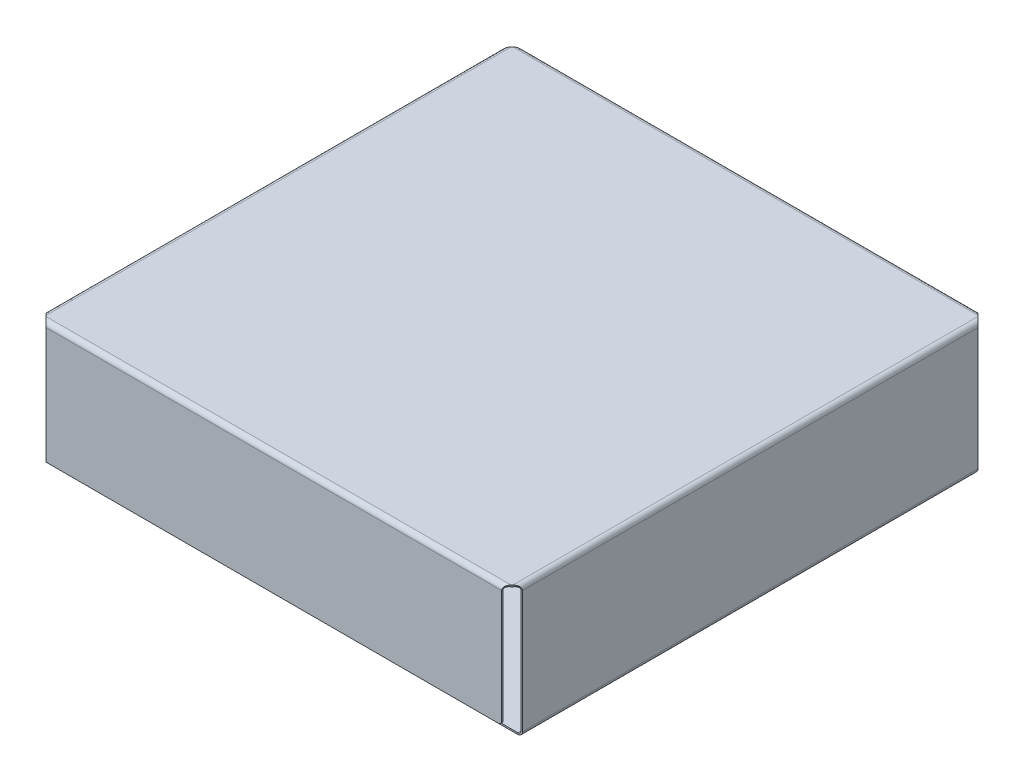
ISO-10303-21;
HEADER;
FILE_DESCRIPTION(('STEP AP214'),'2;1');
FILE_NAME('part.step','',(''),(''),'','','');
FILE_SCHEMA(('AUTOMOTIVE_DESIGN { 1 0 10303 214 1 1 1 1 }'));
ENDSEC;
DATA;
#1=APPLICATION_CONTEXT('core data for automotive mechanical design processes');
#2=APPLICATION_PROTOCOL_DEFINITION('international standard','automotive_design',2000,#1);
#3=PRODUCT_CONTEXT('',#1,'mechanical');
#4=PRODUCT('Part','Part','',(#3));
#5=PRODUCT_RELATED_PRODUCT_CATEGORY('part','',(#4));
#6=PRODUCT_DEFINITION_FORMATION('','',#4);
#7=PRODUCT_DEFINITION_CONTEXT('part definition',#1,'design');
#8=PRODUCT_DEFINITION('design','',#6,#7);
#9=PRODUCT_DEFINITION_SHAPE('','',#8);
#10=(LENGTH_UNIT() NAMED_UNIT(*) SI_UNIT(.MILLI.,.METRE.));
#11=(NAMED_UNIT(*) PLANE_ANGLE_UNIT() SI_UNIT($,.RADIAN.));
#12=(NAMED_UNIT(*) SI_UNIT($,.STERADIAN.) SOLID_ANGLE_UNIT());
#13=UNCERTAINTY_MEASURE_WITH_UNIT(LENGTH_MEASURE(1.E-05),#10,'distance_accuracy_value','');
#14=(GEOMETRIC_REPRESENTATION_CONTEXT(3) GLOBAL_UNCERTAINTY_ASSIGNED_CONTEXT((#13)) GLOBAL_UNIT_ASSIGNED_CONTEXT((#10,
#11,#12)) REPRESENTATION_CONTEXT('',''));
#15=CARTESIAN_POINT('',(0.,0.,0.));
#16=DIRECTION('',(0.,0.,1.));
#17=DIRECTION('',(1.,0.,0.));
#18=AXIS2_PLACEMENT_3D('',#15,#16,#17);
#19=CARTESIAN_POINT('',(0.,0.,36.4317864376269));
#20=DIRECTION('',(0.,0.,-1.));
#21=DIRECTION('',(-1.,0.,0.));
#22=AXIS2_PLACEMENT_3D('',#19,#20,#21);
#23=PLANE('',#22);
#24=DIRECTION('',(0.,-1.,0.));
#25=VECTOR('',#24,1.);
#26=CARTESIAN_POINT('',(37.338,0.,36.4317864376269));
#27=LINE('',#26,#25);
#28=CARTESIAN_POINT('',(37.338,0.253999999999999,36.4317864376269));
#29=VERTEX_POINT('',#28);
#30=CARTESIAN_POINT('',(37.338,0.,36.4317864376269));
#31=VERTEX_POINT('',#30);
#32=EDGE_CURVE('E11',#29,#31,#27,.T.);
#33=ORIENTED_EDGE('',*,*,#32,.F.);
#34=DIRECTION('',(1.,0.,0.));
#35=VECTOR('',#34,1.);
#36=CARTESIAN_POINT('',(0.,0.254,36.4317864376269));
#37=LINE('',#36,#35);
#38=CARTESIAN_POINT('',(-36.4317864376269,0.254,36.4317864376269));
#39=VERTEX_POINT('',#38);
#40=EDGE_CURVE('E220',#29,#39,#37,.F.);
#41=ORIENTED_EDGE('',*,*,#40,.T.);
#42=DIRECTION('',(0.,-1.,0.));
#43=VECTOR('',#42,1.);
#44=CARTESIAN_POINT('',(-36.4317864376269,0.,36.4317864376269));
#45=LINE('',#44,#43);
#46=CARTESIAN_POINT('',(-36.4317864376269,0.,36.4317864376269));
#47=VERTEX_POINT('',#46);
#48=EDGE_CURVE('E45',#39,#47,#45,.T.);
#49=ORIENTED_EDGE('',*,*,#48,.T.);
#50=DIRECTION('',(-1.,0.,0.));
#51=VECTOR('',#50,1.);
#52=CARTESIAN_POINT('',(0.,0.,36.4317864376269));
#53=LINE('',#52,#51);
#54=EDGE_CURVE('E352',#31,#47,#53,.T.);
#55=ORIENTED_EDGE('',*,*,#54,.F.);
#56=EDGE_LOOP('',(#33,#41,#49,#55));
#57=FACE_BOUND('',#56,.T.);
#58=ADVANCED_FACE('F35',(#57),#23,.F.);
#59=CARTESIAN_POINT('',(-36.4317864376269,0.,0.));
#60=DIRECTION('',(1.,0.,0.));
#61=DIRECTION('',(0.,0.,-1.));
#62=AXIS2_PLACEMENT_3D('',#59,#60,#61);
#63=PLANE('',#62);
#64=ORIENTED_EDGE('',*,*,#48,.F.);
#65=DIRECTION('',(0.,0.,1.));
#66=VECTOR('',#65,1.);
#67=CARTESIAN_POINT('',(-36.4317864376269,0.254,0.));
#68=LINE('',#67,#66);
#69=CARTESIAN_POINT('',(-36.4317864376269,0.254,-36.4317864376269));
#70=VERTEX_POINT('',#69);
#71=EDGE_CURVE('E236',#39,#70,#68,.F.);
#72=ORIENTED_EDGE('',*,*,#71,.T.);
#73=DIRECTION('',(0.,-1.,0.));
#74=VECTOR('',#73,1.);
#75=CARTESIAN_POINT('',(-36.4317864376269,0.,-36.4317864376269));
#76=LINE('',#75,#74);
#77=CARTESIAN_POINT('',(-36.4317864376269,0.,-36.4317864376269));
#78=VERTEX_POINT('',#77);
#79=EDGE_CURVE('E346',#70,#78,#76,.T.);
#80=ORIENTED_EDGE('',*,*,#79,.T.);
#81=DIRECTION('',(0.,0.,-1.));
#82=VECTOR('',#81,1.);
#83=CARTESIAN_POINT('',(-36.4317864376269,0.,0.));
#84=LINE('',#83,#82);
#85=EDGE_CURVE('E363',#47,#78,#84,.T.);
#86=ORIENTED_EDGE('',*,*,#85,.F.);
#87=EDGE_LOOP('',(#64,#72,#80,#86));
#88=FACE_BOUND('',#87,.T.);
#89=ADVANCED_FACE('F368',(#88),#63,.F.);
#90=CARTESIAN_POINT('',(0.,0.,-36.4317864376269));
#91=DIRECTION('',(0.,0.,1.));
#92=DIRECTION('',(1.,0.,0.));
#93=AXIS2_PLACEMENT_3D('',#90,#91,#92);
#94=PLANE('',#93);
#95=ORIENTED_EDGE('',*,*,#79,.F.);
#96=DIRECTION('',(1.,0.,0.));
#97=VECTOR('',#96,1.);
#98=CARTESIAN_POINT('',(0.,0.254,-36.4317864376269));
#99=LINE('',#98,#97);
#100=CARTESIAN_POINT('',(37.338,0.254,-36.4317864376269));
#101=VERTEX_POINT('',#100);
#102=EDGE_CURVE('E252',#70,#101,#99,.T.);
#103=ORIENTED_EDGE('',*,*,#102,.T.);
#104=DIRECTION('',(0.,-1.,0.));
#105=VECTOR('',#104,1.);
#106=CARTESIAN_POINT('',(37.338,0.,-36.4317864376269));
#107=LINE('',#106,#105);
#108=CARTESIAN_POINT('',(37.338,0.,-36.4317864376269));
#109=VERTEX_POINT('',#108);
#110=EDGE_CURVE('E53',#101,#109,#107,.T.);
#111=ORIENTED_EDGE('',*,*,#110,.T.);
#112=DIRECTION('',(1.,0.,0.));
#113=VECTOR('',#112,1.);
#114=CARTESIAN_POINT('',(0.,0.,-36.4317864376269));
#115=LINE('',#114,#113);
#116=EDGE_CURVE('E388',#78,#109,#115,.T.);
#117=ORIENTED_EDGE('',*,*,#116,.F.);
#118=EDGE_LOOP('',(#95,#103,#111,#117));
#119=FACE_BOUND('',#118,.T.);
#120=ADVANCED_FACE('F626',(#119),#94,.F.);
#121=CARTESIAN_POINT('',(37.338,0.761999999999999,-36.4317864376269));
#122=DIRECTION('',(0.,0.,1.));
#123=DIRECTION('',(1.,0.,0.));
#124=AXIS2_PLACEMENT_3D('',#121,#122,#123);
#125=PLANE('',#124);
#126=ORIENTED_EDGE('',*,*,#110,.F.);
#127=CARTESIAN_POINT('',(37.338,0.761999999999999,-36.4317864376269));
#128=DIRECTION('',(0.,0.,-1.));
#129=DIRECTION('',(-1.,0.,0.));
#130=AXIS2_PLACEMENT_3D('',#127,#128,#129);
#131=CIRCLE('',#130,0.508);
#132=CARTESIAN_POINT('',(37.846,0.761999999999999,-36.4317864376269));
#133=VERTEX_POINT('',#132);
#134=EDGE_CURVE('E186',#101,#133,#131,.F.);
#135=ORIENTED_EDGE('',*,*,#134,.T.);
#136=DIRECTION('',(1.,0.,0.));
#137=VECTOR('',#136,1.);
#138=CARTESIAN_POINT('',(38.1,0.761999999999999,-36.4317864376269));
#139=LINE('',#138,#137);
#140=CARTESIAN_POINT('',(38.1,0.761999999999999,-36.4317864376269));
#141=VERTEX_POINT('',#140);
#142=EDGE_CURVE('E342',#133,#141,#139,.T.);
#143=ORIENTED_EDGE('',*,*,#142,.T.);
#144=CARTESIAN_POINT('',(37.338,0.761999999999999,-36.4317864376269));
#145=DIRECTION('',(0.,0.,-1.));
#146=DIRECTION('',(-1.,0.,0.));
#147=AXIS2_PLACEMENT_3D('',#144,#145,#146);
#148=CIRCLE('',#147,0.762);
#149=EDGE_CURVE('E439',#109,#141,#148,.F.);
#150=ORIENTED_EDGE('',*,*,#149,.F.);
#151=EDGE_LOOP('',(#126,#135,#143,#150));
#152=FACE_BOUND('',#151,.T.);
#153=ADVANCED_FACE('F564',(#152),#125,.F.);
#154=CARTESIAN_POINT('',(38.1,21.082,-36.4317864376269));
#155=DIRECTION('',(0.,0.,1.));
#156=DIRECTION('',(0.,1.,0.));
#157=AXIS2_PLACEMENT_3D('',#154,#155,#156);
#158=PLANE('',#157);
#159=ORIENTED_EDGE('',*,*,#142,.F.);
#160=DIRECTION('',(0.,1.,0.));
#161=VECTOR('',#160,1.);
#162=CARTESIAN_POINT('',(37.846,21.082,-36.4317864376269));
#163=LINE('',#162,#161);
#164=CARTESIAN_POINT('',(37.846,20.32,-36.4317864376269));
#165=VERTEX_POINT('',#164);
#166=EDGE_CURVE('E175',#133,#165,#163,.T.);
#167=ORIENTED_EDGE('',*,*,#166,.T.);
#168=DIRECTION('',(1.,0.,0.));
#169=VECTOR('',#168,1.);
#170=CARTESIAN_POINT('',(38.1,20.32,-36.4317864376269));
#171=LINE('',#170,#169);
#172=CARTESIAN_POINT('',(38.1,20.32,-36.4317864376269));
#173=VERTEX_POINT('',#172);
#174=EDGE_CURVE('E339',#165,#173,#171,.T.);
#175=ORIENTED_EDGE('',*,*,#174,.T.);
#176=DIRECTION('',(0.,1.,0.));
#177=VECTOR('',#176,1.);
#178=CARTESIAN_POINT('',(38.1,21.082,-36.4317864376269));
#179=LINE('',#178,#177);
#180=EDGE_CURVE('E556',#141,#173,#179,.T.);
#181=ORIENTED_EDGE('',*,*,#180,.F.);
#182=EDGE_LOOP('',(#159,#167,#175,#181));
#183=FACE_BOUND('',#182,.T.);
#184=ADVANCED_FACE('F633',(#183),#158,.F.);
#185=CARTESIAN_POINT('',(37.846,20.32,-36.4317864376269));
#186=CARTESIAN_POINT('',(37.9306666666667,20.32,-36.4317864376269));
#187=CARTESIAN_POINT('',(38.0153333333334,20.32,-36.4317864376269));
#188=CARTESIAN_POINT('',(38.1,20.32,-36.4317864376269));
#189=CARTESIAN_POINT('',(37.846,21.336,-36.4317864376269));
#190=CARTESIAN_POINT('',(37.9306666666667,21.5053333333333,-36.4317864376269));
#191=CARTESIAN_POINT('',(38.0153333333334,21.6746666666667,-36.4317864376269));
#192=CARTESIAN_POINT('',(38.1,21.844,-36.4317864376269));
#193=CARTESIAN_POINT('',(36.83,21.336,-37.9557864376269));
#194=CARTESIAN_POINT('',(36.7453333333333,21.5053333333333,-37.9557864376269));
#195=CARTESIAN_POINT('',(36.6606666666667,21.6746666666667,-37.9557864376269));
#196=CARTESIAN_POINT('',(36.576,21.844,-37.9557864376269));
#197=CARTESIAN_POINT('',(36.83,20.32,-37.9557864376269));
#198=CARTESIAN_POINT('',(36.7453333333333,20.32,-37.9557864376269));
#199=CARTESIAN_POINT('',(36.6606666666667,20.32,-37.9557864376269));
#200=CARTESIAN_POINT('',(36.576,20.32,-37.9557864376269));
#201=CARTESIAN_POINT('',(36.83,19.304,-37.9557864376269));
#202=CARTESIAN_POINT('',(36.7453333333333,19.1346666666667,-37.9557864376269));
#203=CARTESIAN_POINT('',(36.6606666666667,18.9653333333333,-37.9557864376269));
#204=CARTESIAN_POINT('',(36.576,18.796,-37.9557864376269));
#205=CARTESIAN_POINT('',(37.846,19.304,-36.4317864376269));
#206=CARTESIAN_POINT('',(37.9306666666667,19.1346666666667,-36.4317864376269));
#207=CARTESIAN_POINT('',(38.0153333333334,18.9653333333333,-36.4317864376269));
#208=CARTESIAN_POINT('',(38.1,18.796,-36.4317864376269));
#209=CARTESIAN_POINT('',(37.846,20.32,-36.4317864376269));
#210=CARTESIAN_POINT('',(37.9306666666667,20.32,-36.4317864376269));
#211=CARTESIAN_POINT('',(38.0153333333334,20.32,-36.4317864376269));
#212=CARTESIAN_POINT('',(38.1,20.32,-36.4317864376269));
#213=(BOUNDED_SURFACE() B_SPLINE_SURFACE(3,3,((#185,#186,#187,#188),(#189,#190,#191,#192),(#193,
#194,#195,#196),(#197,#198,#199,#200),(#201,#202,#203,#204),(#205,#206,#207,#208),(#209,#210,
#211,#212)),.UNSPECIFIED.,.T.,.F.,.F.) B_SPLINE_SURFACE_WITH_KNOTS((4,3,4),(4,4),(0.,0.5,1.),
(0.,1.),.UNSPECIFIED.) GEOMETRIC_REPRESENTATION_ITEM() RATIONAL_B_SPLINE_SURFACE(((1.,1.,1.,1.),
(0.333333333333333,0.333333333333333,0.333333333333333,0.333333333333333),(0.333333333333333,
0.333333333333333,0.333333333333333,0.333333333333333),(1.,1.,1.,1.),(0.333333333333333,
0.333333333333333,0.333333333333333,0.333333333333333),(0.333333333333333,0.333333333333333,
0.333333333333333,0.333333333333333),(1.,1.,1.,1.))) REPRESENTATION_ITEM('') SURFACE());
#214=CARTESIAN_POINT('',(37.338,20.32,-37.1937864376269));
#215=DIRECTION('',(-0.832050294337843,0.,0.554700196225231));
#216=DIRECTION('',(0.554700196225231,0.,0.832050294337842));
#217=AXIS2_PLACEMENT_3D('',#214,#215,#216);
#218=ELLIPSE('',#217,0.915810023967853,0.508);
#219=CARTESIAN_POINT('',(37.338,20.828,-37.1937864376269));
#220=VERTEX_POINT('',#219);
#221=EDGE_CURVE('E185',#165,#220,#218,.T.);
#222=DIRECTION('',(0.,1.,0.));
#223=VECTOR('',#222,1.);
#224=CARTESIAN_POINT('',(37.338,21.082,-37.1937864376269));
#225=LINE('',#224,#223);
#226=CARTESIAN_POINT('',(37.338,21.082,-37.1937864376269));
#227=VERTEX_POINT('',#226);
#228=EDGE_CURVE('E336',#220,#227,#225,.T.);
#229=CARTESIAN_POINT('',(37.338,20.32,-37.1937864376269));
#230=DIRECTION('',(-0.707106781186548,0.,0.707106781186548));
#231=DIRECTION('',(0.707106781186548,0.,0.707106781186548));
#232=AXIS2_PLACEMENT_3D('',#229,#230,#231);
#233=ELLIPSE('',#232,1.0776307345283,0.762);
#234=EDGE_CURVE('E431',#173,#227,#233,.T.);
#235=ORIENTED_EDGE('',*,*,#174,.F.);
#236=ORIENTED_EDGE('',*,*,#221,.T.);
#237=ORIENTED_EDGE('',*,*,#228,.T.);
#238=ORIENTED_EDGE('',*,*,#234,.F.);
#239=EDGE_LOOP('',(#235,#236,#237,#238));
#240=FACE_BOUND('',#239,.T.);
#241=ADVANCED_FACE('F636',(#240),#213,.T.);
#242=CARTESIAN_POINT('',(37.2658932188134,21.082,-37.2658932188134));
#243=DIRECTION('',(-0.707106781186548,0.,0.707106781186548));
#244=DIRECTION('',(0.707106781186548,0.,0.707106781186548));
#245=AXIS2_PLACEMENT_3D('',#242,#243,#244);
#246=PLANE('',#245);
#247=ORIENTED_EDGE('',*,*,#228,.F.);
#248=DIRECTION('',(0.707106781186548,0.,0.707106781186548));
#249=VECTOR('',#248,1.);
#250=CARTESIAN_POINT('',(37.2658932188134,20.828,-37.2658932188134));
#251=LINE('',#250,#249);
#252=CARTESIAN_POINT('',(37.1937864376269,20.828,-37.338));
#253=VERTEX_POINT('',#252);
#254=EDGE_CURVE('E241',#220,#253,#251,.F.);
#255=ORIENTED_EDGE('',*,*,#254,.T.);
#256=DIRECTION('',(0.,1.,0.));
#257=VECTOR('',#256,1.);
#258=CARTESIAN_POINT('',(37.1937864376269,21.082,-37.338));
#259=LINE('',#258,#257);
#260=CARTESIAN_POINT('',(37.1937864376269,21.082,-37.338));
#261=VERTEX_POINT('',#260);
#262=EDGE_CURVE('E333',#253,#261,#259,.T.);
#263=ORIENTED_EDGE('',*,*,#262,.T.);
#264=DIRECTION('',(0.707106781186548,0.,0.707106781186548));
#265=VECTOR('',#264,1.);
#266=CARTESIAN_POINT('',(37.2658932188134,21.082,-37.2658932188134));
#267=LINE('',#266,#265);
#268=EDGE_CURVE('E517',#227,#261,#267,.F.);
#269=ORIENTED_EDGE('',*,*,#268,.F.);
#270=EDGE_LOOP('',(#247,#255,#263,#269));
#271=FACE_BOUND('',#270,.T.);
#272=ADVANCED_FACE('F555',(#271),#246,.F.);
#273=CARTESIAN_POINT('',(37.9557864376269,20.32,-36.83));
#274=CARTESIAN_POINT('',(37.9557864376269,20.32,-36.7453333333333));
#275=CARTESIAN_POINT('',(37.9557864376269,20.32,-36.6606666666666));
#276=CARTESIAN_POINT('',(37.9557864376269,20.32,-36.576));
#277=CARTESIAN_POINT('',(37.9557864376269,21.336,-36.83));
#278=CARTESIAN_POINT('',(37.9557864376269,21.5053333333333,-36.7453333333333));
#279=CARTESIAN_POINT('',(37.9557864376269,21.6746666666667,-36.6606666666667));
#280=CARTESIAN_POINT('',(37.9557864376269,21.844,-36.576));
#281=CARTESIAN_POINT('',(36.4317864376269,21.336,-37.846));
#282=CARTESIAN_POINT('',(36.4317864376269,21.5053333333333,-37.9306666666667));
#283=CARTESIAN_POINT('',(36.4317864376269,21.6746666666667,-38.0153333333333));
#284=CARTESIAN_POINT('',(36.4317864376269,21.844,-38.1));
#285=CARTESIAN_POINT('',(36.4317864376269,20.32,-37.846));
#286=CARTESIAN_POINT('',(36.4317864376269,20.32,-37.9306666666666));
#287=CARTESIAN_POINT('',(36.4317864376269,20.32,-38.0153333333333));
#288=CARTESIAN_POINT('',(36.4317864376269,20.32,-38.1));
#289=CARTESIAN_POINT('',(36.4317864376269,19.304,-37.846));
#290=CARTESIAN_POINT('',(36.4317864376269,19.1346666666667,-37.9306666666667));
#291=CARTESIAN_POINT('',(36.4317864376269,18.9653333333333,-38.0153333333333));
#292=CARTESIAN_POINT('',(36.4317864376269,18.796,-38.1));
#293=CARTESIAN_POINT('',(37.9557864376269,19.304,-36.83));
#294=CARTESIAN_POINT('',(37.9557864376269,19.1346666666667,-36.7453333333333));
#295=CARTESIAN_POINT('',(37.9557864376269,18.9653333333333,-36.6606666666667));
#296=CARTESIAN_POINT('',(37.9557864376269,18.796,-36.576));
#297=CARTESIAN_POINT('',(37.9557864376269,20.32,-36.83));
#298=CARTESIAN_POINT('',(37.9557864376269,20.32,-36.7453333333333));
#299=CARTESIAN_POINT('',(37.9557864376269,20.32,-36.6606666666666));
#300=CARTESIAN_POINT('',(37.9557864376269,20.32,-36.576));
#301=(BOUNDED_SURFACE() B_SPLINE_SURFACE(3,3,((#273,#274,#275,#276),(#277,#278,#279,#280),(#281,
#282,#283,#284),(#285,#286,#287,#288),(#289,#290,#291,#292),(#293,#294,#295,#296),(#297,#298,
#299,#300)),.UNSPECIFIED.,.T.,.F.,.F.) B_SPLINE_SURFACE_WITH_KNOTS((4,3,4),(4,4),(0.,0.5,1.),
(0.,1.),.UNSPECIFIED.) GEOMETRIC_REPRESENTATION_ITEM() RATIONAL_B_SPLINE_SURFACE(((1.,1.,1.,1.),
(0.333333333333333,0.333333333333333,0.333333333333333,0.333333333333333),(0.333333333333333,
0.333333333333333,0.333333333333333,0.333333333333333),(1.,1.,1.,1.),(0.333333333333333,
0.333333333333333,0.333333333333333,0.333333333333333),(0.333333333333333,0.333333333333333,
0.333333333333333,0.333333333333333),(1.,1.,1.,1.))) REPRESENTATION_ITEM('') SURFACE());
#302=CARTESIAN_POINT('',(37.1937864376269,20.32,-37.338));
#303=DIRECTION('',(-0.554700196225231,0.,0.832050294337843));
#304=DIRECTION('',(0.832050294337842,0.,0.554700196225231));
#305=AXIS2_PLACEMENT_3D('',#302,#303,#304);
#306=ELLIPSE('',#305,0.915810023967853,0.508);
#307=CARTESIAN_POINT('',(36.4317864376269,20.32,-37.846));
#308=VERTEX_POINT('',#307);
#309=EDGE_CURVE('E231',#253,#308,#306,.T.);
#310=DIRECTION('',(0.,0.,-1.));
#311=VECTOR('',#310,1.);
#312=CARTESIAN_POINT('',(36.4317864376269,20.32,-38.1));
#313=LINE('',#312,#311);
#314=CARTESIAN_POINT('',(36.4317864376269,20.32,-38.1));
#315=VERTEX_POINT('',#314);
#316=EDGE_CURVE('E330',#308,#315,#313,.T.);
#317=CARTESIAN_POINT('',(37.1937864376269,20.32,-37.338));
#318=DIRECTION('',(-0.707106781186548,0.,0.707106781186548));
#319=DIRECTION('',(0.707106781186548,0.,0.707106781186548));
#320=AXIS2_PLACEMENT_3D('',#317,#318,#319);
#321=ELLIPSE('',#320,1.0776307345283,0.762);
#322=EDGE_CURVE('E410',#261,#315,#321,.T.);
#323=ORIENTED_EDGE('',*,*,#262,.F.);
#324=ORIENTED_EDGE('',*,*,#309,.T.);
#325=ORIENTED_EDGE('',*,*,#316,.T.);
#326=ORIENTED_EDGE('',*,*,#322,.F.);
#327=EDGE_LOOP('',(#323,#324,#325,#326));
#328=FACE_BOUND('',#327,.T.);
#329=ADVANCED_FACE('F475',(#328),#301,.T.);
#330=CARTESIAN_POINT('',(36.4317864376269,21.082,-38.1));
#331=DIRECTION('',(-1.,0.,0.));
#332=DIRECTION('',(0.,-1.,0.));
#333=AXIS2_PLACEMENT_3D('',#330,#331,#332);
#334=PLANE('',#333);
#335=ORIENTED_EDGE('',*,*,#316,.F.);
#336=DIRECTION('',(0.,1.,0.));
#337=VECTOR('',#336,1.);
#338=CARTESIAN_POINT('',(36.4317864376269,21.082,-37.846));
#339=LINE('',#338,#337);
#340=CARTESIAN_POINT('',(36.4317864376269,2.1762135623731,-37.846));
#341=VERTEX_POINT('',#340);
#342=EDGE_CURVE('E256',#308,#341,#339,.F.);
#343=ORIENTED_EDGE('',*,*,#342,.T.);
#344=DIRECTION('',(0.,0.,-1.));
#345=VECTOR('',#344,1.);
#346=CARTESIAN_POINT('',(36.4317864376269,2.1762135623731,-38.1));
#347=LINE('',#346,#345);
#348=CARTESIAN_POINT('',(36.4317864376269,2.1762135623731,-38.1));
#349=VERTEX_POINT('',#348);
#350=EDGE_CURVE('E327',#341,#349,#347,.T.);
#351=ORIENTED_EDGE('',*,*,#350,.T.);
#352=DIRECTION('',(0.,-1.,0.));
#353=VECTOR('',#352,1.);
#354=CARTESIAN_POINT('',(36.4317864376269,21.082,-38.1));
#355=LINE('',#354,#353);
#356=EDGE_CURVE('E387',#315,#349,#355,.T.);
#357=ORIENTED_EDGE('',*,*,#356,.F.);
#358=EDGE_LOOP('',(#335,#343,#351,#357));
#359=FACE_BOUND('',#358,.T.);
#360=ADVANCED_FACE('F613',(#359),#334,.F.);
#361=CARTESIAN_POINT('',(35.9237864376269,2.17621356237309,-38.1));
#362=DIRECTION('',(0.,0.,1.));
#363=DIRECTION('',(1.,0.,0.));
#364=AXIS2_PLACEMENT_3D('',#361,#362,#363);
#365=CYLINDRICAL_SURFACE('',#364,0.508);
#366=ORIENTED_EDGE('',*,*,#350,.F.);
#367=CARTESIAN_POINT('',(35.9237864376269,2.17621356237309,-37.846));
#368=DIRECTION('',(0.,0.,1.));
#369=DIRECTION('',(1.,0.,0.));
#370=AXIS2_PLACEMENT_3D('',#367,#368,#369);
#371=CIRCLE('',#370,0.508);
#372=CARTESIAN_POINT('',(35.9237864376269,1.66821356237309,-37.846));
#373=VERTEX_POINT('',#372);
#374=EDGE_CURVE('E253',#341,#373,#371,.F.);
#375=ORIENTED_EDGE('',*,*,#374,.T.);
#376=DIRECTION('',(0.,0.,-1.));
#377=VECTOR('',#376,1.);
#378=CARTESIAN_POINT('',(35.9237864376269,1.66821356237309,-38.1));
#379=LINE('',#378,#377);
#380=CARTESIAN_POINT('',(35.9237864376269,1.66821356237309,-38.1));
#381=VERTEX_POINT('',#380);
#382=EDGE_CURVE('E324',#373,#381,#379,.T.);
#383=ORIENTED_EDGE('',*,*,#382,.T.);
#384=CARTESIAN_POINT('',(35.9237864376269,2.17621356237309,-38.1));
#385=DIRECTION('',(0.,0.,1.));
#386=DIRECTION('',(1.,0.,0.));
#387=AXIS2_PLACEMENT_3D('',#384,#385,#386);
#388=CIRCLE('',#387,0.508);
#389=EDGE_CURVE('E385',#349,#381,#388,.F.);
#390=ORIENTED_EDGE('',*,*,#389,.F.);
#391=EDGE_LOOP('',(#366,#375,#383,#390));
#392=FACE_BOUND('',#391,.T.);
#393=ADVANCED_FACE('F610',(#392),#365,.T.);
#394=CARTESIAN_POINT('',(-38.1,1.66821356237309,-38.1));
#395=DIRECTION('',(0.,1.,0.));
#396=DIRECTION('',(-1.,0.,0.));
#397=AXIS2_PLACEMENT_3D('',#394,#395,#396);
#398=PLANE('',#397);
#399=ORIENTED_EDGE('',*,*,#382,.F.);
#400=DIRECTION('',(1.,0.,0.));
#401=VECTOR('',#400,1.);
#402=CARTESIAN_POINT('',(-38.1,1.66821356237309,-37.846));
#403=LINE('',#402,#401);
#404=CARTESIAN_POINT('',(-36.4317864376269,1.66821356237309,-37.846));
#405=VERTEX_POINT('',#404);
#406=EDGE_CURVE('E226',#373,#405,#403,.F.);
#407=ORIENTED_EDGE('',*,*,#406,.T.);
#408=DIRECTION('',(0.,0.,-1.));
#409=VECTOR('',#408,1.);
#410=CARTESIAN_POINT('',(-36.4317864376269,1.66821356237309,-38.1));
#411=LINE('',#410,#409);
#412=CARTESIAN_POINT('',(-36.4317864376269,1.66821356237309,-38.1));
#413=VERTEX_POINT('',#412);
#414=EDGE_CURVE('E321',#405,#413,#411,.T.);
#415=ORIENTED_EDGE('',*,*,#414,.T.);
#416=DIRECTION('',(-1.,0.,0.));
#417=VECTOR('',#416,1.);
#418=CARTESIAN_POINT('',(-38.1,1.66821356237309,-38.1));
#419=LINE('',#418,#417);
#420=EDGE_CURVE('E400',#381,#413,#419,.T.);
#421=ORIENTED_EDGE('',*,*,#420,.F.);
#422=EDGE_LOOP('',(#399,#407,#415,#421));
#423=FACE_BOUND('',#422,.T.);
#424=ADVANCED_FACE('F608',(#423),#398,.F.);
#425=CARTESIAN_POINT('',(-36.4317864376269,21.082,-38.1));
#426=DIRECTION('',(1.,0.,0.));
#427=DIRECTION('',(0.,1.,0.));
#428=AXIS2_PLACEMENT_3D('',#425,#426,#427);
#429=PLANE('',#428);
#430=ORIENTED_EDGE('',*,*,#414,.F.);
#431=DIRECTION('',(0.,1.,0.));
#432=VECTOR('',#431,1.);
#433=CARTESIAN_POINT('',(-36.4317864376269,21.082,-37.846));
#434=LINE('',#433,#432);
#435=CARTESIAN_POINT('',(-36.4317864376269,20.32,-37.846));
#436=VERTEX_POINT('',#435);
#437=EDGE_CURVE('E240',#405,#436,#434,.T.);
#438=ORIENTED_EDGE('',*,*,#437,.T.);
#439=DIRECTION('',(0.,0.,-1.));
#440=VECTOR('',#439,1.);
#441=CARTESIAN_POINT('',(-36.4317864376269,20.32,-38.1));
#442=LINE('',#441,#440);
#443=CARTESIAN_POINT('',(-36.4317864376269,20.32,-38.1));
#444=VERTEX_POINT('',#443);
#445=EDGE_CURVE('E318',#436,#444,#442,.T.);
#446=ORIENTED_EDGE('',*,*,#445,.T.);
#447=DIRECTION('',(0.,1.,0.));
#448=VECTOR('',#447,1.);
#449=CARTESIAN_POINT('',(-36.4317864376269,21.082,-38.1));
#450=LINE('',#449,#448);
#451=EDGE_CURVE('E504',#413,#444,#450,.T.);
#452=ORIENTED_EDGE('',*,*,#451,.F.);
#453=EDGE_LOOP('',(#430,#438,#446,#452));
#454=FACE_BOUND('',#453,.T.);
#455=ADVANCED_FACE('F503',(#454),#429,.F.);
#456=CARTESIAN_POINT('',(-36.4317864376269,20.32,-37.846));
#457=CARTESIAN_POINT('',(-36.4317864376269,20.32,-37.9306666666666));
#458=CARTESIAN_POINT('',(-36.4317864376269,20.32,-38.0153333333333));
#459=CARTESIAN_POINT('',(-36.4317864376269,20.32,-38.1));
#460=CARTESIAN_POINT('',(-36.4317864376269,21.336,-37.846));
#461=CARTESIAN_POINT('',(-36.4317864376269,21.5053333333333,-37.9306666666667));
#462=CARTESIAN_POINT('',(-36.4317864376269,21.6746666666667,-38.0153333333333));
#463=CARTESIAN_POINT('',(-36.4317864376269,21.844,-38.1));
#464=CARTESIAN_POINT('',(-37.9557864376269,21.336,-36.83));
#465=CARTESIAN_POINT('',(-37.9557864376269,21.5053333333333,-36.7453333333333));
#466=CARTESIAN_POINT('',(-37.9557864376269,21.6746666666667,-36.6606666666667));
#467=CARTESIAN_POINT('',(-37.9557864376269,21.844,-36.576));
#468=CARTESIAN_POINT('',(-37.9557864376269,20.32,-36.83));
#469=CARTESIAN_POINT('',(-37.9557864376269,20.32,-36.7453333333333));
#470=CARTESIAN_POINT('',(-37.9557864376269,20.32,-36.6606666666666));
#471=CARTESIAN_POINT('',(-37.9557864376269,20.32,-36.576));
#472=CARTESIAN_POINT('',(-37.9557864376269,19.304,-36.83));
#473=CARTESIAN_POINT('',(-37.9557864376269,19.1346666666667,-36.7453333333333));
#474=CARTESIAN_POINT('',(-37.9557864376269,18.9653333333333,-36.6606666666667));
#475=CARTESIAN_POINT('',(-37.9557864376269,18.796,-36.576));
#476=CARTESIAN_POINT('',(-36.4317864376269,19.304,-37.846));
#477=CARTESIAN_POINT('',(-36.4317864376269,19.1346666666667,-37.9306666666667));
#478=CARTESIAN_POINT('',(-36.4317864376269,18.9653333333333,-38.0153333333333));
#479=CARTESIAN_POINT('',(-36.4317864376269,18.796,-38.1));
#480=CARTESIAN_POINT('',(-36.4317864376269,20.32,-37.846));
#481=CARTESIAN_POINT('',(-36.4317864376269,20.32,-37.9306666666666));
#482=CARTESIAN_POINT('',(-36.4317864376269,20.32,-38.0153333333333));
#483=CARTESIAN_POINT('',(-36.4317864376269,20.32,-38.1));
#484=(BOUNDED_SURFACE() B_SPLINE_SURFACE(3,3,((#456,#457,#458,#459),(#460,#461,#462,#463),(#464,
#465,#466,#467),(#468,#469,#470,#471),(#472,#473,#474,#475),(#476,#477,#478,#479),(#480,#481,
#482,#483)),.UNSPECIFIED.,.T.,.F.,.F.) B_SPLINE_SURFACE_WITH_KNOTS((4,3,4),(4,4),(0.,0.5,1.),
(0.,1.),.UNSPECIFIED.) GEOMETRIC_REPRESENTATION_ITEM() RATIONAL_B_SPLINE_SURFACE(((1.,1.,1.,1.),
(0.333333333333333,0.333333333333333,0.333333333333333,0.333333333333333),(0.333333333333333,
0.333333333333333,0.333333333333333,0.333333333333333),(1.,1.,1.,1.),(0.333333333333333,
0.333333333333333,0.333333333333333,0.333333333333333),(0.333333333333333,0.333333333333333,
0.333333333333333,0.333333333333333),(1.,1.,1.,1.))) REPRESENTATION_ITEM('') SURFACE());
#485=CARTESIAN_POINT('',(-37.1937864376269,20.32,-37.338));
#486=DIRECTION('',(0.554700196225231,0.,0.832050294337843));
#487=DIRECTION('',(0.832050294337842,0.,-0.554700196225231));
#488=AXIS2_PLACEMENT_3D('',#485,#486,#487);
#489=ELLIPSE('',#488,0.915810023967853,0.508);
#490=CARTESIAN_POINT('',(-37.1937864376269,20.828,-37.338));
#491=VERTEX_POINT('',#490);
#492=EDGE_CURVE('E205',#436,#491,#489,.T.);
#493=DIRECTION('',(0.,1.,0.));
#494=VECTOR('',#493,1.);
#495=CARTESIAN_POINT('',(-37.1937864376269,21.082,-37.338));
#496=LINE('',#495,#494);
#497=CARTESIAN_POINT('',(-37.1937864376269,21.082,-37.338));
#498=VERTEX_POINT('',#497);
#499=EDGE_CURVE('E315',#491,#498,#496,.T.);
#500=CARTESIAN_POINT('',(-37.1937864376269,20.32,-37.338));
#501=DIRECTION('',(0.707106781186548,0.,0.707106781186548));
#502=DIRECTION('',(0.707106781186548,0.,-0.707106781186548));
#503=AXIS2_PLACEMENT_3D('',#500,#501,#502);
#504=ELLIPSE('',#503,1.0776307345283,0.762);
#505=EDGE_CURVE('E419',#444,#498,#504,.T.);
#506=ORIENTED_EDGE('',*,*,#445,.F.);
#507=ORIENTED_EDGE('',*,*,#492,.T.);
#508=ORIENTED_EDGE('',*,*,#499,.T.);
#509=ORIENTED_EDGE('',*,*,#505,.F.);
#510=EDGE_LOOP('',(#506,#507,#508,#509));
#511=FACE_BOUND('',#510,.T.);
#512=ADVANCED_FACE('F495',(#511),#484,.T.);
#513=CARTESIAN_POINT('',(-37.2658932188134,21.082,-37.2658932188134));
#514=DIRECTION('',(0.707106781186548,0.,0.707106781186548));
#515=DIRECTION('',(0.707106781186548,0.,-0.707106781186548));
#516=AXIS2_PLACEMENT_3D('',#513,#514,#515);
#517=PLANE('',#516);
#518=ORIENTED_EDGE('',*,*,#499,.F.);
#519=DIRECTION('',(0.707106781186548,0.,-0.707106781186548));
#520=VECTOR('',#519,1.);
#521=CARTESIAN_POINT('',(-37.2658932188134,20.828,-37.2658932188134));
#522=LINE('',#521,#520);
#523=CARTESIAN_POINT('',(-37.338,20.828,-37.1937864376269));
#524=VERTEX_POINT('',#523);
#525=EDGE_CURVE('E221',#491,#524,#522,.F.);
#526=ORIENTED_EDGE('',*,*,#525,.T.);
#527=DIRECTION('',(0.,1.,0.));
#528=VECTOR('',#527,1.);
#529=CARTESIAN_POINT('',(-37.338,21.082,-37.1937864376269));
#530=LINE('',#529,#528);
#531=CARTESIAN_POINT('',(-37.338,21.082,-37.1937864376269));
#532=VERTEX_POINT('',#531);
#533=EDGE_CURVE('E312',#524,#532,#530,.T.);
#534=ORIENTED_EDGE('',*,*,#533,.T.);
#535=DIRECTION('',(0.707106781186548,0.,-0.707106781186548));
#536=VECTOR('',#535,1.);
#537=CARTESIAN_POINT('',(-37.2658932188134,21.082,-37.2658932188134));
#538=LINE('',#537,#536);
#539=EDGE_CURVE('E511',#498,#532,#538,.F.);
#540=ORIENTED_EDGE('',*,*,#539,.F.);
#541=EDGE_LOOP('',(#518,#526,#534,#540));
#542=FACE_BOUND('',#541,.T.);
#543=ADVANCED_FACE('F708',(#542),#517,.F.);
#544=CARTESIAN_POINT('',(-36.83,20.32,-37.9557864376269));
#545=CARTESIAN_POINT('',(-36.7453333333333,20.32,-37.9557864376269));
#546=CARTESIAN_POINT('',(-36.6606666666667,20.32,-37.9557864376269));
#547=CARTESIAN_POINT('',(-36.576,20.32,-37.9557864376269));
#548=CARTESIAN_POINT('',(-36.83,21.336,-37.9557864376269));
#549=CARTESIAN_POINT('',(-36.7453333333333,21.5053333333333,-37.9557864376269));
#550=CARTESIAN_POINT('',(-36.6606666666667,21.6746666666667,-37.9557864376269));
#551=CARTESIAN_POINT('',(-36.576,21.844,-37.9557864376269));
#552=CARTESIAN_POINT('',(-37.846,21.336,-36.4317864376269));
#553=CARTESIAN_POINT('',(-37.9306666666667,21.5053333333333,-36.4317864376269));
#554=CARTESIAN_POINT('',(-38.0153333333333,21.6746666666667,-36.4317864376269));
#555=CARTESIAN_POINT('',(-38.1,21.844,-36.4317864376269));
#556=CARTESIAN_POINT('',(-37.846,20.32,-36.4317864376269));
#557=CARTESIAN_POINT('',(-37.9306666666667,20.32,-36.4317864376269));
#558=CARTESIAN_POINT('',(-38.0153333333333,20.32,-36.4317864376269));
#559=CARTESIAN_POINT('',(-38.1,20.32,-36.4317864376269));
#560=CARTESIAN_POINT('',(-37.846,19.304,-36.4317864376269));
#561=CARTESIAN_POINT('',(-37.9306666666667,19.1346666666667,-36.4317864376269));
#562=CARTESIAN_POINT('',(-38.0153333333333,18.9653333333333,-36.4317864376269));
#563=CARTESIAN_POINT('',(-38.1,18.796,-36.4317864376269));
#564=CARTESIAN_POINT('',(-36.83,19.304,-37.9557864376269));
#565=CARTESIAN_POINT('',(-36.7453333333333,19.1346666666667,-37.9557864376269));
#566=CARTESIAN_POINT('',(-36.6606666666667,18.9653333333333,-37.9557864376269));
#567=CARTESIAN_POINT('',(-36.576,18.796,-37.9557864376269));
#568=CARTESIAN_POINT('',(-36.83,20.32,-37.9557864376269));
#569=CARTESIAN_POINT('',(-36.7453333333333,20.32,-37.9557864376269));
#570=CARTESIAN_POINT('',(-36.6606666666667,20.32,-37.9557864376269));
#571=CARTESIAN_POINT('',(-36.576,20.32,-37.9557864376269));
#572=(BOUNDED_SURFACE() B_SPLINE_SURFACE(3,3,((#544,#545,#546,#547),(#548,#549,#550,#551),(#552,
#553,#554,#555),(#556,#557,#558,#559),(#560,#561,#562,#563),(#564,#565,#566,#567),(#568,#569,
#570,#571)),.UNSPECIFIED.,.T.,.F.,.F.) B_SPLINE_SURFACE_WITH_KNOTS((4,3,4),(4,4),(0.,0.5,1.),
(0.,1.),.UNSPECIFIED.) GEOMETRIC_REPRESENTATION_ITEM() RATIONAL_B_SPLINE_SURFACE(((1.,1.,1.,1.),
(0.333333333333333,0.333333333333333,0.333333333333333,0.333333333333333),(0.333333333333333,
0.333333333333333,0.333333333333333,0.333333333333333),(1.,1.,1.,1.),(0.333333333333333,
0.333333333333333,0.333333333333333,0.333333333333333),(0.333333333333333,0.333333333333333,
0.333333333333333,0.333333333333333),(1.,1.,1.,1.))) REPRESENTATION_ITEM('') SURFACE());
#573=CARTESIAN_POINT('',(-37.338,20.32,-37.1937864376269));
#574=DIRECTION('',(0.832050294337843,0.,0.554700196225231));
#575=DIRECTION('',(0.554700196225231,0.,-0.832050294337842));
#576=AXIS2_PLACEMENT_3D('',#573,#574,#575);
#577=ELLIPSE('',#576,0.915810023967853,0.508);
#578=CARTESIAN_POINT('',(-37.846,20.32,-36.4317864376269));
#579=VERTEX_POINT('',#578);
#580=EDGE_CURVE('E214',#524,#579,#577,.T.);
#581=DIRECTION('',(-1.,0.,0.));
#582=VECTOR('',#581,1.);
#583=CARTESIAN_POINT('',(-38.1,20.32,-36.4317864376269));
#584=LINE('',#583,#582);
#585=CARTESIAN_POINT('',(-38.1,20.32,-36.4317864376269));
#586=VERTEX_POINT('',#585);
#587=EDGE_CURVE('E309',#579,#586,#584,.T.);
#588=CARTESIAN_POINT('',(-37.338,20.32,-37.1937864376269));
#589=DIRECTION('',(0.707106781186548,0.,0.707106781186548));
#590=DIRECTION('',(0.707106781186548,0.,-0.707106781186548));
#591=AXIS2_PLACEMENT_3D('',#588,#589,#590);
#592=ELLIPSE('',#591,1.0776307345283,0.762);
#593=EDGE_CURVE('E397',#532,#586,#592,.T.);
#594=ORIENTED_EDGE('',*,*,#533,.F.);
#595=ORIENTED_EDGE('',*,*,#580,.T.);
#596=ORIENTED_EDGE('',*,*,#587,.T.);
#597=ORIENTED_EDGE('',*,*,#593,.F.);
#598=EDGE_LOOP('',(#594,#595,#596,#597));
#599=FACE_BOUND('',#598,.T.);
#600=ADVANCED_FACE('F719',(#599),#572,.T.);
#601=CARTESIAN_POINT('',(-38.1,21.082,-36.4317864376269));
#602=DIRECTION('',(0.,0.,1.));
#603=DIRECTION('',(0.,-1.,0.));
#604=AXIS2_PLACEMENT_3D('',#601,#602,#603);
#605=PLANE('',#604);
#606=ORIENTED_EDGE('',*,*,#587,.F.);
#607=DIRECTION('',(0.,1.,0.));
#608=VECTOR('',#607,1.);
#609=CARTESIAN_POINT('',(-37.846,21.082,-36.4317864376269));
#610=LINE('',#609,#608);
#611=CARTESIAN_POINT('',(-37.846,1.66821356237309,-36.4317864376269));
#612=VERTEX_POINT('',#611);
#613=EDGE_CURVE('E237',#579,#612,#610,.F.);
#614=ORIENTED_EDGE('',*,*,#613,.T.);
#615=DIRECTION('',(-1.,0.,0.));
#616=VECTOR('',#615,1.);
#617=CARTESIAN_POINT('',(-38.1,1.6682135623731,-36.4317864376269));
#618=LINE('',#617,#616);
#619=CARTESIAN_POINT('',(-38.1,1.6682135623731,-36.4317864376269));
#620=VERTEX_POINT('',#619);
#621=EDGE_CURVE('E306',#612,#620,#618,.T.);
#622=ORIENTED_EDGE('',*,*,#621,.T.);
#623=DIRECTION('',(0.,-1.,0.));
#624=VECTOR('',#623,1.);
#625=CARTESIAN_POINT('',(-38.1,21.082,-36.4317864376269));
#626=LINE('',#625,#624);
#627=EDGE_CURVE('E512',#586,#620,#626,.T.);
#628=ORIENTED_EDGE('',*,*,#627,.F.);
#629=EDGE_LOOP('',(#606,#614,#622,#628));
#630=FACE_BOUND('',#629,.T.);
#631=ADVANCED_FACE('F728',(#630),#605,.F.);
#632=CARTESIAN_POINT('',(-38.1,1.66821356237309,-38.1));
#633=DIRECTION('',(0.,1.,0.));
#634=DIRECTION('',(0.,0.,1.));
#635=AXIS2_PLACEMENT_3D('',#632,#633,#634);
#636=PLANE('',#635);
#637=ORIENTED_EDGE('',*,*,#621,.F.);
#638=DIRECTION('',(0.,0.,-1.));
#639=VECTOR('',#638,1.);
#640=CARTESIAN_POINT('',(-37.846,1.66821356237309,-38.1));
#641=LINE('',#640,#639);
#642=CARTESIAN_POINT('',(-37.846,1.66821356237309,36.4317864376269));
#643=VERTEX_POINT('',#642);
#644=EDGE_CURVE('E209',#612,#643,#641,.F.);
#645=ORIENTED_EDGE('',*,*,#644,.T.);
#646=DIRECTION('',(-1.,0.,0.));
#647=VECTOR('',#646,1.);
#648=CARTESIAN_POINT('',(-38.1,1.6682135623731,36.4317864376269));
#649=LINE('',#648,#647);
#650=CARTESIAN_POINT('',(-38.1,1.6682135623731,36.4317864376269));
#651=VERTEX_POINT('',#650);
#652=EDGE_CURVE('E303',#643,#651,#649,.T.);
#653=ORIENTED_EDGE('',*,*,#652,.T.);
#654=DIRECTION('',(0.,0.,1.));
#655=VECTOR('',#654,1.);
#656=CARTESIAN_POINT('',(-38.1,1.66821356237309,-38.1));
#657=LINE('',#656,#655);
#658=EDGE_CURVE('E370',#620,#651,#657,.T.);
#659=ORIENTED_EDGE('',*,*,#658,.F.);
#660=EDGE_LOOP('',(#637,#645,#653,#659));
#661=FACE_BOUND('',#660,.T.);
#662=ADVANCED_FACE('F739',(#661),#636,.F.);
#663=CARTESIAN_POINT('',(-38.1,21.082,36.4317864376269));
#664=DIRECTION('',(0.,0.,-1.));
#665=DIRECTION('',(0.,1.,0.));
#666=AXIS2_PLACEMENT_3D('',#663,#664,#665);
#667=PLANE('',#666);
#668=ORIENTED_EDGE('',*,*,#652,.F.);
#669=DIRECTION('',(0.,1.,0.));
#670=VECTOR('',#669,1.);
#671=CARTESIAN_POINT('',(-37.846,21.082,36.4317864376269));
#672=LINE('',#671,#670);
#673=CARTESIAN_POINT('',(-37.846,20.32,36.4317864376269));
#674=VERTEX_POINT('',#673);
#675=EDGE_CURVE('E198',#643,#674,#672,.T.);
#676=ORIENTED_EDGE('',*,*,#675,.T.);
#677=DIRECTION('',(-1.,0.,0.));
#678=VECTOR('',#677,1.);
#679=CARTESIAN_POINT('',(-38.1,20.32,36.4317864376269));
#680=LINE('',#679,#678);
#681=CARTESIAN_POINT('',(-38.1,20.32,36.4317864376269));
#682=VERTEX_POINT('',#681);
#683=EDGE_CURVE('E300',#674,#682,#680,.T.);
#684=ORIENTED_EDGE('',*,*,#683,.T.);
#685=DIRECTION('',(0.,1.,0.));
#686=VECTOR('',#685,1.);
#687=CARTESIAN_POINT('',(-38.1,21.082,36.4317864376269));
#688=LINE('',#687,#686);
#689=EDGE_CURVE('E525',#651,#682,#688,.T.);
#690=ORIENTED_EDGE('',*,*,#689,.F.);
#691=EDGE_LOOP('',(#668,#676,#684,#690));
#692=FACE_BOUND('',#691,.T.);
#693=ADVANCED_FACE('F750',(#692),#667,.F.);
#694=CARTESIAN_POINT('',(-37.846,20.32,36.4317864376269));
#695=CARTESIAN_POINT('',(-37.9306666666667,20.32,36.4317864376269));
#696=CARTESIAN_POINT('',(-38.0153333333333,20.32,36.4317864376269));
#697=CARTESIAN_POINT('',(-38.1,20.32,36.4317864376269));
#698=CARTESIAN_POINT('',(-37.846,21.336,36.4317864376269));
#699=CARTESIAN_POINT('',(-37.9306666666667,21.5053333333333,36.4317864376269));
#700=CARTESIAN_POINT('',(-38.0153333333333,21.6746666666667,36.4317864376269));
#701=CARTESIAN_POINT('',(-38.1,21.844,36.4317864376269));
#702=CARTESIAN_POINT('',(-36.83,21.336,37.9557864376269));
#703=CARTESIAN_POINT('',(-36.7453333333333,21.5053333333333,37.9557864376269));
#704=CARTESIAN_POINT('',(-36.6606666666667,21.6746666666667,37.9557864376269));
#705=CARTESIAN_POINT('',(-36.576,21.844,37.9557864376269));
#706=CARTESIAN_POINT('',(-36.83,20.32,37.9557864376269));
#707=CARTESIAN_POINT('',(-36.7453333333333,20.32,37.9557864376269));
#708=CARTESIAN_POINT('',(-36.6606666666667,20.32,37.9557864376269));
#709=CARTESIAN_POINT('',(-36.576,20.32,37.9557864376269));
#710=CARTESIAN_POINT('',(-36.83,19.304,37.9557864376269));
#711=CARTESIAN_POINT('',(-36.7453333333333,19.1346666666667,37.9557864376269));
#712=CARTESIAN_POINT('',(-36.6606666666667,18.9653333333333,37.9557864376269));
#713=CARTESIAN_POINT('',(-36.576,18.796,37.9557864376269));
#714=CARTESIAN_POINT('',(-37.846,19.304,36.4317864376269));
#715=CARTESIAN_POINT('',(-37.9306666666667,19.1346666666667,36.4317864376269));
#716=CARTESIAN_POINT('',(-38.0153333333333,18.9653333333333,36.4317864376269));
#717=CARTESIAN_POINT('',(-38.1,18.796,36.4317864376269));
#718=CARTESIAN_POINT('',(-37.846,20.32,36.4317864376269));
#719=CARTESIAN_POINT('',(-37.9306666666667,20.32,36.4317864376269));
#720=CARTESIAN_POINT('',(-38.0153333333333,20.32,36.4317864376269));
#721=CARTESIAN_POINT('',(-38.1,20.32,36.4317864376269));
#722=(BOUNDED_SURFACE() B_SPLINE_SURFACE(3,3,((#694,#695,#696,#697),(#698,#699,#700,#701),(#702,
#703,#704,#705),(#706,#707,#708,#709),(#710,#711,#712,#713),(#714,#715,#716,#717),(#718,#719,
#720,#721)),.UNSPECIFIED.,.T.,.F.,.F.) B_SPLINE_SURFACE_WITH_KNOTS((4,3,4),(4,4),(0.,0.5,1.),
(0.,1.),.UNSPECIFIED.) GEOMETRIC_REPRESENTATION_ITEM() RATIONAL_B_SPLINE_SURFACE(((1.,1.,1.,1.),
(0.333333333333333,0.333333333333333,0.333333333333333,0.333333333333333),(0.333333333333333,
0.333333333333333,0.333333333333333,0.333333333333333),(1.,1.,1.,1.),(0.333333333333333,
0.333333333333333,0.333333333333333,0.333333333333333),(0.333333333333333,0.333333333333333,
0.333333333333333,0.333333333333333),(1.,1.,1.,1.))) REPRESENTATION_ITEM('') SURFACE());
#723=CARTESIAN_POINT('',(-37.338,20.32,37.1937864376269));
#724=DIRECTION('',(0.832050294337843,0.,-0.554700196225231));
#725=DIRECTION('',(-0.554700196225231,0.,-0.832050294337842));
#726=AXIS2_PLACEMENT_3D('',#723,#724,#725);
#727=ELLIPSE('',#726,0.915810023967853,0.508);
#728=CARTESIAN_POINT('',(-37.338,20.828,37.1937864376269));
#729=VERTEX_POINT('',#728);
#730=EDGE_CURVE('E228',#674,#729,#727,.T.);
#731=DIRECTION('',(0.,1.,0.));
#732=VECTOR('',#731,1.);
#733=CARTESIAN_POINT('',(-37.338,21.082,37.1937864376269));
#734=LINE('',#733,#732);
#735=CARTESIAN_POINT('',(-37.338,21.082,37.1937864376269));
#736=VERTEX_POINT('',#735);
#737=EDGE_CURVE('E297',#729,#736,#734,.T.);
#738=CARTESIAN_POINT('',(-37.338,20.32,37.1937864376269));
#739=DIRECTION('',(0.707106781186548,0.,-0.707106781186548));
#740=DIRECTION('',(-0.707106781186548,0.,-0.707106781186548));
#741=AXIS2_PLACEMENT_3D('',#738,#739,#740);
#742=ELLIPSE('',#741,1.0776307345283,0.762);
#743=EDGE_CURVE('E407',#682,#736,#742,.T.);
#744=ORIENTED_EDGE('',*,*,#683,.F.);
#745=ORIENTED_EDGE('',*,*,#730,.T.);
#746=ORIENTED_EDGE('',*,*,#737,.T.);
#747=ORIENTED_EDGE('',*,*,#743,.F.);
#748=EDGE_LOOP('',(#744,#745,#746,#747));
#749=FACE_BOUND('',#748,.T.);
#750=ADVANCED_FACE('F762',(#749),#722,.T.);
#751=CARTESIAN_POINT('',(-37.2658932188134,21.082,37.2658932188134));
#752=DIRECTION('',(0.707106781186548,0.,-0.707106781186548));
#753=DIRECTION('',(-0.707106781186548,0.,-0.707106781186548));
#754=AXIS2_PLACEMENT_3D('',#751,#752,#753);
#755=PLANE('',#754);
#756=ORIENTED_EDGE('',*,*,#737,.F.);
#757=DIRECTION('',(-0.707106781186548,0.,-0.707106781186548));
#758=VECTOR('',#757,1.);
#759=CARTESIAN_POINT('',(-37.2658932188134,20.828,37.2658932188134));
#760=LINE('',#759,#758);
#761=CARTESIAN_POINT('',(-37.1937864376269,20.828,37.338));
#762=VERTEX_POINT('',#761);
#763=EDGE_CURVE('E192',#729,#762,#760,.F.);
#764=ORIENTED_EDGE('',*,*,#763,.T.);
#765=DIRECTION('',(0.,1.,0.));
#766=VECTOR('',#765,1.);
#767=CARTESIAN_POINT('',(-37.1937864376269,21.082,37.338));
#768=LINE('',#767,#766);
#769=CARTESIAN_POINT('',(-37.1937864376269,21.082,37.338));
#770=VERTEX_POINT('',#769);
#771=EDGE_CURVE('E294',#762,#770,#768,.T.);
#772=ORIENTED_EDGE('',*,*,#771,.T.);
#773=DIRECTION('',(-0.707106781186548,0.,-0.707106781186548));
#774=VECTOR('',#773,1.);
#775=CARTESIAN_POINT('',(-37.2658932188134,21.082,37.2658932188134));
#776=LINE('',#775,#774);
#777=EDGE_CURVE('E528',#736,#770,#776,.F.);
#778=ORIENTED_EDGE('',*,*,#777,.F.);
#779=EDGE_LOOP('',(#756,#764,#772,#778));
#780=FACE_BOUND('',#779,.T.);
#781=ADVANCED_FACE('F774',(#780),#755,.F.);
#782=CARTESIAN_POINT('',(-37.9557864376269,20.32,36.83));
#783=CARTESIAN_POINT('',(-37.9557864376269,20.32,36.7453333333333));
#784=CARTESIAN_POINT('',(-37.9557864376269,20.32,36.6606666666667));
#785=CARTESIAN_POINT('',(-37.9557864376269,20.32,36.576));
#786=CARTESIAN_POINT('',(-37.9557864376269,21.336,36.83));
#787=CARTESIAN_POINT('',(-37.9557864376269,21.5053333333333,36.7453333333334));
#788=CARTESIAN_POINT('',(-37.9557864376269,21.6746666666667,36.6606666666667));
#789=CARTESIAN_POINT('',(-37.9557864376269,21.844,36.576));
#790=CARTESIAN_POINT('',(-36.4317864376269,21.336,37.846));
#791=CARTESIAN_POINT('',(-36.4317864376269,21.5053333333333,37.9306666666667));
#792=CARTESIAN_POINT('',(-36.4317864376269,21.6746666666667,38.0153333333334));
#793=CARTESIAN_POINT('',(-36.4317864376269,21.844,38.1));
#794=CARTESIAN_POINT('',(-36.4317864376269,20.32,37.846));
#795=CARTESIAN_POINT('',(-36.4317864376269,20.32,37.9306666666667));
#796=CARTESIAN_POINT('',(-36.4317864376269,20.32,38.0153333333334));
#797=CARTESIAN_POINT('',(-36.4317864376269,20.32,38.1));
#798=CARTESIAN_POINT('',(-36.4317864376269,19.304,37.846));
#799=CARTESIAN_POINT('',(-36.4317864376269,19.1346666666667,37.9306666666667));
#800=CARTESIAN_POINT('',(-36.4317864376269,18.9653333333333,38.0153333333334));
#801=CARTESIAN_POINT('',(-36.4317864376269,18.796,38.1));
#802=CARTESIAN_POINT('',(-37.9557864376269,19.304,36.83));
#803=CARTESIAN_POINT('',(-37.9557864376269,19.1346666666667,36.7453333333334));
#804=CARTESIAN_POINT('',(-37.9557864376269,18.9653333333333,36.6606666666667));
#805=CARTESIAN_POINT('',(-37.9557864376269,18.796,36.576));
#806=CARTESIAN_POINT('',(-37.9557864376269,20.32,36.83));
#807=CARTESIAN_POINT('',(-37.9557864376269,20.32,36.7453333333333));
#808=CARTESIAN_POINT('',(-37.9557864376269,20.32,36.6606666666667));
#809=CARTESIAN_POINT('',(-37.9557864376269,20.32,36.576));
#810=(BOUNDED_SURFACE() B_SPLINE_SURFACE(3,3,((#782,#783,#784,#785),(#786,#787,#788,#789),(#790,
#791,#792,#793),(#794,#795,#796,#797),(#798,#799,#800,#801),(#802,#803,#804,#805),(#806,#807,
#808,#809)),.UNSPECIFIED.,.T.,.F.,.F.) B_SPLINE_SURFACE_WITH_KNOTS((4,3,4),(4,4),(0.,0.5,1.),
(0.,1.),.UNSPECIFIED.) GEOMETRIC_REPRESENTATION_ITEM() RATIONAL_B_SPLINE_SURFACE(((1.,1.,1.,1.),
(0.333333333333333,0.333333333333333,0.333333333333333,0.333333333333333),(0.333333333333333,
0.333333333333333,0.333333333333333,0.333333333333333),(1.,1.,1.,1.),(0.333333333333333,
0.333333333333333,0.333333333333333,0.333333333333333),(0.333333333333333,0.333333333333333,
0.333333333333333,0.333333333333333),(1.,1.,1.,1.))) REPRESENTATION_ITEM('') SURFACE());
#811=CARTESIAN_POINT('',(-37.1937864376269,20.32,37.338));
#812=DIRECTION('',(0.554700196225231,0.,-0.832050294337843));
#813=DIRECTION('',(-0.832050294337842,0.,-0.554700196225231));
#814=AXIS2_PLACEMENT_3D('',#811,#812,#813);
#815=ELLIPSE('',#814,0.915810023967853,0.508);
#816=CARTESIAN_POINT('',(-36.4317864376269,20.32,37.846));
#817=VERTEX_POINT('',#816);
#818=EDGE_CURVE('E213',#762,#817,#815,.T.);
#819=DIRECTION('',(0.,0.,1.));
#820=VECTOR('',#819,1.);
#821=CARTESIAN_POINT('',(-36.4317864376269,20.32,38.1));
#822=LINE('',#821,#820);
#823=CARTESIAN_POINT('',(-36.4317864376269,20.32,38.1));
#824=VERTEX_POINT('',#823);
#825=EDGE_CURVE('E291',#817,#824,#822,.T.);
#826=CARTESIAN_POINT('',(-37.1937864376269,20.32,37.338));
#827=DIRECTION('',(0.707106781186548,0.,-0.707106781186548));
#828=DIRECTION('',(-0.707106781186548,0.,-0.707106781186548));
#829=AXIS2_PLACEMENT_3D('',#826,#827,#828);
#830=ELLIPSE('',#829,1.0776307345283,0.762);
#831=EDGE_CURVE('E396',#770,#824,#830,.T.);
#832=ORIENTED_EDGE('',*,*,#771,.F.);
#833=ORIENTED_EDGE('',*,*,#818,.T.);
#834=ORIENTED_EDGE('',*,*,#825,.T.);
#835=ORIENTED_EDGE('',*,*,#831,.F.);
#836=EDGE_LOOP('',(#832,#833,#834,#835));
#837=FACE_BOUND('',#836,.T.);
#838=ADVANCED_FACE('F785',(#837),#810,.T.);
#839=CARTESIAN_POINT('',(-36.4317864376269,21.082,38.1));
#840=DIRECTION('',(1.,0.,0.));
#841=DIRECTION('',(0.,-1.,0.));
#842=AXIS2_PLACEMENT_3D('',#839,#840,#841);
#843=PLANE('',#842);
#844=ORIENTED_EDGE('',*,*,#825,.F.);
#845=DIRECTION('',(0.,1.,0.));
#846=VECTOR('',#845,1.);
#847=CARTESIAN_POINT('',(-36.4317864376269,21.082,37.846));
#848=LINE('',#847,#846);
#849=CARTESIAN_POINT('',(-36.4317864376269,1.66821356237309,37.846));
#850=VERTEX_POINT('',#849);
#851=EDGE_CURVE('E222',#817,#850,#848,.F.);
#852=ORIENTED_EDGE('',*,*,#851,.T.);
#853=DIRECTION('',(0.,0.,1.));
#854=VECTOR('',#853,1.);
#855=CARTESIAN_POINT('',(-36.4317864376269,1.6682135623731,38.1));
#856=LINE('',#855,#854);
#857=CARTESIAN_POINT('',(-36.4317864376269,1.6682135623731,38.1));
#858=VERTEX_POINT('',#857);
#859=EDGE_CURVE('E288',#850,#858,#856,.T.);
#860=ORIENTED_EDGE('',*,*,#859,.T.);
#861=DIRECTION('',(0.,-1.,0.));
#862=VECTOR('',#861,1.);
#863=CARTESIAN_POINT('',(-36.4317864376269,21.082,38.1));
#864=LINE('',#863,#862);
#865=EDGE_CURVE('E365',#824,#858,#864,.T.);
#866=ORIENTED_EDGE('',*,*,#865,.F.);
#867=EDGE_LOOP('',(#844,#852,#860,#866));
#868=FACE_BOUND('',#867,.T.);
#869=ADVANCED_FACE('F795',(#868),#843,.F.);
#870=CARTESIAN_POINT('',(-38.1,1.66821356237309,38.1));
#871=DIRECTION('',(0.,1.,0.));
#872=DIRECTION('',(1.,0.,0.));
#873=AXIS2_PLACEMENT_3D('',#870,#871,#872);
#874=PLANE('',#873);
#875=ORIENTED_EDGE('',*,*,#859,.F.);
#876=DIRECTION('',(-1.,0.,0.));
#877=VECTOR('',#876,1.);
#878=CARTESIAN_POINT('',(-38.1,1.66821356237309,37.846));
#879=LINE('',#878,#877);
#880=CARTESIAN_POINT('',(35.9237864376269,1.66821356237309,37.846));
#881=VERTEX_POINT('',#880);
#882=EDGE_CURVE('E217',#850,#881,#879,.F.);
#883=ORIENTED_EDGE('',*,*,#882,.T.);
#884=DIRECTION('',(0.,0.,1.));
#885=VECTOR('',#884,1.);
#886=CARTESIAN_POINT('',(35.9237864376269,1.66821356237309,38.1));
#887=LINE('',#886,#885);
#888=CARTESIAN_POINT('',(35.9237864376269,1.66821356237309,38.1));
#889=VERTEX_POINT('',#888);
#890=EDGE_CURVE('E285',#881,#889,#887,.T.);
#891=ORIENTED_EDGE('',*,*,#890,.T.);
#892=DIRECTION('',(1.,0.,0.));
#893=VECTOR('',#892,1.);
#894=CARTESIAN_POINT('',(-38.1,1.66821356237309,38.1));
#895=LINE('',#894,#893);
#896=EDGE_CURVE('E366',#858,#889,#895,.T.);
#897=ORIENTED_EDGE('',*,*,#896,.F.);
#898=EDGE_LOOP('',(#875,#883,#891,#897));
#899=FACE_BOUND('',#898,.T.);
#900=ADVANCED_FACE('F806',(#899),#874,.F.);
#901=CARTESIAN_POINT('',(35.9237864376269,2.17621356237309,38.1));
#902=DIRECTION('',(0.,0.,-1.));
#903=DIRECTION('',(-1.,0.,0.));
#904=AXIS2_PLACEMENT_3D('',#901,#902,#903);
#905=CYLINDRICAL_SURFACE('',#904,0.508);
#906=ORIENTED_EDGE('',*,*,#890,.F.);
#907=CARTESIAN_POINT('',(35.9237864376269,2.17621356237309,37.846));
#908=DIRECTION('',(0.,0.,-1.));
#909=DIRECTION('',(-1.,0.,0.));
#910=AXIS2_PLACEMENT_3D('',#907,#908,#909);
#911=CIRCLE('',#910,0.508);
#912=CARTESIAN_POINT('',(36.4317864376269,2.1762135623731,37.846));
#913=VERTEX_POINT('',#912);
#914=EDGE_CURVE('E191',#881,#913,#911,.F.);
#915=ORIENTED_EDGE('',*,*,#914,.T.);
#916=DIRECTION('',(0.,0.,1.));
#917=VECTOR('',#916,1.);
#918=CARTESIAN_POINT('',(36.4317864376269,2.1762135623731,38.1));
#919=LINE('',#918,#917);
#920=CARTESIAN_POINT('',(36.4317864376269,2.1762135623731,38.1));
#921=VERTEX_POINT('',#920);
#922=EDGE_CURVE('E282',#913,#921,#919,.T.);
#923=ORIENTED_EDGE('',*,*,#922,.T.);
#924=CARTESIAN_POINT('',(35.9237864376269,2.17621356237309,38.1));
#925=DIRECTION('',(0.,0.,-1.));
#926=DIRECTION('',(-1.,0.,0.));
#927=AXIS2_PLACEMENT_3D('',#924,#925,#926);
#928=CIRCLE('',#927,0.508);
#929=EDGE_CURVE('E380',#889,#921,#928,.F.);
#930=ORIENTED_EDGE('',*,*,#929,.F.);
#931=EDGE_LOOP('',(#906,#915,#923,#930));
#932=FACE_BOUND('',#931,.T.);
#933=ADVANCED_FACE('F816',(#932),#905,.T.);
#934=CARTESIAN_POINT('',(36.4317864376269,21.082,38.1));
#935=DIRECTION('',(-1.,0.,0.));
#936=DIRECTION('',(0.,1.,0.));
#937=AXIS2_PLACEMENT_3D('',#934,#935,#936);
#938=PLANE('',#937);
#939=ORIENTED_EDGE('',*,*,#922,.F.);
#940=DIRECTION('',(0.,1.,0.));
#941=VECTOR('',#940,1.);
#942=CARTESIAN_POINT('',(36.4317864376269,21.082,37.846));
#943=LINE('',#942,#941);
#944=CARTESIAN_POINT('',(36.4317864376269,20.32,37.846));
#945=VERTEX_POINT('',#944);
#946=EDGE_CURVE('E195',#913,#945,#943,.T.);
#947=ORIENTED_EDGE('',*,*,#946,.T.);
#948=DIRECTION('',(0.,0.,1.));
#949=VECTOR('',#948,1.);
#950=CARTESIAN_POINT('',(36.4317864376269,20.32,38.1));
#951=LINE('',#950,#949);
#952=CARTESIAN_POINT('',(36.4317864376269,20.32,38.1));
#953=VERTEX_POINT('',#952);
#954=EDGE_CURVE('E279',#945,#953,#951,.T.);
#955=ORIENTED_EDGE('',*,*,#954,.T.);
#956=DIRECTION('',(0.,1.,0.));
#957=VECTOR('',#956,1.);
#958=CARTESIAN_POINT('',(36.4317864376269,21.082,38.1));
#959=LINE('',#958,#957);
#960=EDGE_CURVE('E383',#921,#953,#959,.T.);
#961=ORIENTED_EDGE('',*,*,#960,.F.);
#962=EDGE_LOOP('',(#939,#947,#955,#961));
#963=FACE_BOUND('',#962,.T.);
#964=ADVANCED_FACE('F827',(#963),#938,.F.);
#965=CARTESIAN_POINT('',(36.4317864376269,20.32,37.846));
#966=CARTESIAN_POINT('',(36.4317864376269,20.32,37.9306666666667));
#967=CARTESIAN_POINT('',(36.4317864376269,20.32,38.0153333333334));
#968=CARTESIAN_POINT('',(36.4317864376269,20.32,38.1));
#969=CARTESIAN_POINT('',(36.4317864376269,21.336,37.846));
#970=CARTESIAN_POINT('',(36.4317864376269,21.5053333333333,37.9306666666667));
#971=CARTESIAN_POINT('',(36.4317864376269,21.6746666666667,38.0153333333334));
#972=CARTESIAN_POINT('',(36.4317864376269,21.844,38.1));
#973=CARTESIAN_POINT('',(37.9557864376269,21.336,36.83));
#974=CARTESIAN_POINT('',(37.9557864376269,21.5053333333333,36.7453333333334));
#975=CARTESIAN_POINT('',(37.9557864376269,21.6746666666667,36.6606666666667));
#976=CARTESIAN_POINT('',(37.9557864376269,21.844,36.576));
#977=CARTESIAN_POINT('',(37.9557864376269,20.32,36.83));
#978=CARTESIAN_POINT('',(37.9557864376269,20.32,36.7453333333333));
#979=CARTESIAN_POINT('',(37.9557864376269,20.32,36.6606666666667));
#980=CARTESIAN_POINT('',(37.9557864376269,20.32,36.576));
#981=CARTESIAN_POINT('',(37.9557864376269,19.304,36.83));
#982=CARTESIAN_POINT('',(37.9557864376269,19.1346666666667,36.7453333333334));
#983=CARTESIAN_POINT('',(37.9557864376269,18.9653333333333,36.6606666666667));
#984=CARTESIAN_POINT('',(37.9557864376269,18.796,36.576));
#985=CARTESIAN_POINT('',(36.4317864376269,19.304,37.846));
#986=CARTESIAN_POINT('',(36.4317864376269,19.1346666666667,37.9306666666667));
#987=CARTESIAN_POINT('',(36.4317864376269,18.9653333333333,38.0153333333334));
#988=CARTESIAN_POINT('',(36.4317864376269,18.796,38.1));
#989=CARTESIAN_POINT('',(36.4317864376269,20.32,37.846));
#990=CARTESIAN_POINT('',(36.4317864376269,20.32,37.9306666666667));
#991=CARTESIAN_POINT('',(36.4317864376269,20.32,38.0153333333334));
#992=CARTESIAN_POINT('',(36.4317864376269,20.32,38.1));
#993=(BOUNDED_SURFACE() B_SPLINE_SURFACE(3,3,((#965,#966,#967,#968),(#969,#970,#971,#972),(#973,
#974,#975,#976),(#977,#978,#979,#980),(#981,#982,#983,#984),(#985,#986,#987,#988),(#989,#990,
#991,#992)),.UNSPECIFIED.,.T.,.F.,.F.) B_SPLINE_SURFACE_WITH_KNOTS((4,3,4),(4,4),(0.,0.5,1.),
(0.,1.),.UNSPECIFIED.) GEOMETRIC_REPRESENTATION_ITEM() RATIONAL_B_SPLINE_SURFACE(((1.,1.,1.,1.),
(0.333333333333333,0.333333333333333,0.333333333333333,0.333333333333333),(0.333333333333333,
0.333333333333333,0.333333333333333,0.333333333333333),(1.,1.,1.,1.),(0.333333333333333,
0.333333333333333,0.333333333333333,0.333333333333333),(0.333333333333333,0.333333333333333,
0.333333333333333,0.333333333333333),(1.,1.,1.,1.))) REPRESENTATION_ITEM('') SURFACE());
#994=CARTESIAN_POINT('',(37.1937864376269,20.32,37.338));
#995=DIRECTION('',(-0.554700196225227,0.,-0.832050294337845));
#996=DIRECTION('',(-0.832050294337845,0.,0.554700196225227));
#997=AXIS2_PLACEMENT_3D('',#994,#995,#996);
#998=ELLIPSE('',#997,0.915810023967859,0.508);
#999=CARTESIAN_POINT('',(37.1937864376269,20.828,37.338));
#1000=VERTEX_POINT('',#999);
#1001=EDGE_CURVE('E210',#945,#1000,#998,.T.);
#1002=DIRECTION('',(0.,1.,0.));
#1003=VECTOR('',#1002,1.);
#1004=CARTESIAN_POINT('',(37.1937864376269,21.082,37.338));
#1005=LINE('',#1004,#1003);
#1006=CARTESIAN_POINT('',(37.1937864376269,21.082,37.338));
#1007=VERTEX_POINT('',#1006);
#1008=EDGE_CURVE('E276',#1000,#1007,#1005,.T.);
#1009=CARTESIAN_POINT('',(37.1937864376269,20.32,37.338));
#1010=DIRECTION('',(-0.707106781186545,0.,-0.70710678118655));
#1011=DIRECTION('',(-0.70710678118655,0.,0.707106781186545));
#1012=AXIS2_PLACEMENT_3D('',#1009,#1010,#1011);
#1013=ELLIPSE('',#1012,1.0776307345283,0.762);
#1014=EDGE_CURVE('E393',#953,#1007,#1013,.T.);
#1015=ORIENTED_EDGE('',*,*,#954,.F.);
#1016=ORIENTED_EDGE('',*,*,#1001,.T.);
#1017=ORIENTED_EDGE('',*,*,#1008,.T.);
#1018=ORIENTED_EDGE('',*,*,#1014,.F.);
#1019=EDGE_LOOP('',(#1015,#1016,#1017,#1018));
#1020=FACE_BOUND('',#1019,.T.);
#1021=ADVANCED_FACE('F839',(#1020),#993,.T.);
#1022=CARTESIAN_POINT('',(37.2658932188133,21.082,37.2658932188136));
#1023=DIRECTION('',(-0.707106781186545,0.,-0.70710678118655));
#1024=DIRECTION('',(-0.70710678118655,0.,0.707106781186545));
#1025=AXIS2_PLACEMENT_3D('',#1022,#1023,#1024);
#1026=PLANE('',#1025);
#1027=ORIENTED_EDGE('',*,*,#1008,.F.);
#1028=DIRECTION('',(-0.70710678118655,0.,0.707106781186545));
#1029=VECTOR('',#1028,1.);
#1030=CARTESIAN_POINT('',(37.2658932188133,20.828,37.2658932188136));
#1031=LINE('',#1030,#1029);
#1032=CARTESIAN_POINT('',(37.338,20.828,37.1937864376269));
#1033=VERTEX_POINT('',#1032);
#1034=EDGE_CURVE('E206',#1000,#1033,#1031,.F.);
#1035=ORIENTED_EDGE('',*,*,#1034,.T.);
#1036=DIRECTION('',(0.,1.,0.));
#1037=VECTOR('',#1036,1.);
#1038=CARTESIAN_POINT('',(37.338,21.082,37.1937864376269));
#1039=LINE('',#1038,#1037);
#1040=CARTESIAN_POINT('',(37.338,21.082,37.1937864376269));
#1041=VERTEX_POINT('',#1040);
#1042=EDGE_CURVE('E273',#1033,#1041,#1039,.T.);
#1043=ORIENTED_EDGE('',*,*,#1042,.T.);
#1044=DIRECTION('',(-0.70710678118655,0.,0.707106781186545));
#1045=VECTOR('',#1044,1.);
#1046=CARTESIAN_POINT('',(37.2658932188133,21.082,37.2658932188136));
#1047=LINE('',#1046,#1045);
#1048=EDGE_CURVE('E376',#1007,#1041,#1047,.F.);
#1049=ORIENTED_EDGE('',*,*,#1048,.F.);
#1050=EDGE_LOOP('',(#1027,#1035,#1043,#1049));
#1051=FACE_BOUND('',#1050,.T.);
#1052=ADVANCED_FACE('F850',(#1051),#1026,.F.);
#1053=CARTESIAN_POINT('',(36.83,20.32,37.9557864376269));
#1054=CARTESIAN_POINT('',(36.7453333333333,20.32,37.9557864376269));
#1055=CARTESIAN_POINT('',(36.6606666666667,20.32,37.9557864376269));
#1056=CARTESIAN_POINT('',(36.576,20.32,37.9557864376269));
#1057=CARTESIAN_POINT('',(36.83,21.336,37.9557864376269));
#1058=CARTESIAN_POINT('',(36.7453333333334,21.5053333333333,37.9557864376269));
#1059=CARTESIAN_POINT('',(36.6606666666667,21.6746666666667,37.9557864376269));
#1060=CARTESIAN_POINT('',(36.576,21.844,37.9557864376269));
#1061=CARTESIAN_POINT('',(37.846,21.336,36.4317864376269));
#1062=CARTESIAN_POINT('',(37.9306666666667,21.5053333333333,36.4317864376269));
#1063=CARTESIAN_POINT('',(38.0153333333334,21.6746666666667,36.4317864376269));
#1064=CARTESIAN_POINT('',(38.1,21.844,36.4317864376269));
#1065=CARTESIAN_POINT('',(37.846,20.32,36.4317864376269));
#1066=CARTESIAN_POINT('',(37.9306666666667,20.32,36.4317864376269));
#1067=CARTESIAN_POINT('',(38.0153333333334,20.32,36.4317864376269));
#1068=CARTESIAN_POINT('',(38.1,20.32,36.4317864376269));
#1069=CARTESIAN_POINT('',(37.846,19.304,36.4317864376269));
#1070=CARTESIAN_POINT('',(37.9306666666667,19.1346666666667,36.4317864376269));
#1071=CARTESIAN_POINT('',(38.0153333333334,18.9653333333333,36.4317864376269));
#1072=CARTESIAN_POINT('',(38.1,18.796,36.4317864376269));
#1073=CARTESIAN_POINT('',(36.83,19.304,37.9557864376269));
#1074=CARTESIAN_POINT('',(36.7453333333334,19.1346666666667,37.9557864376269));
#1075=CARTESIAN_POINT('',(36.6606666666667,18.9653333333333,37.9557864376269));
#1076=CARTESIAN_POINT('',(36.576,18.796,37.9557864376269));
#1077=CARTESIAN_POINT('',(36.83,20.32,37.9557864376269));
#1078=CARTESIAN_POINT('',(36.7453333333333,20.32,37.9557864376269));
#1079=CARTESIAN_POINT('',(36.6606666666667,20.32,37.9557864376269));
#1080=CARTESIAN_POINT('',(36.576,20.32,37.9557864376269));
#1081=(BOUNDED_SURFACE() B_SPLINE_SURFACE(3,3,((#1053,#1054,#1055,#1056),(#1057,#1058,#1059,
#1060),(#1061,#1062,#1063,#1064),(#1065,#1066,#1067,#1068),(#1069,#1070,#1071,#1072),(#1073,
#1074,#1075,#1076),(#1077,#1078,#1079,#1080)),.UNSPECIFIED.,.T.,.F.,
.F.) B_SPLINE_SURFACE_WITH_KNOTS((4,3,4),(4,4),(0.,0.5,1.),(0.,1.),
.UNSPECIFIED.) GEOMETRIC_REPRESENTATION_ITEM() RATIONAL_B_SPLINE_SURFACE(((1.,1.,1.,1.),
(0.333333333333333,0.333333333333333,0.333333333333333,0.333333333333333),(0.333333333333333,
0.333333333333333,0.333333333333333,0.333333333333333),(1.,1.,1.,1.),(0.333333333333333,
0.333333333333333,0.333333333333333,0.333333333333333),(0.333333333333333,0.333333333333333,
0.333333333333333,0.333333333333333),(1.,1.,1.,1.))) REPRESENTATION_ITEM('') SURFACE());
#1082=CARTESIAN_POINT('',(37.338,20.32,37.1937864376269));
#1083=DIRECTION('',(-0.83205029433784,0.,-0.554700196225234));
#1084=DIRECTION('',(-0.554700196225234,0.,0.83205029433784));
#1085=AXIS2_PLACEMENT_3D('',#1082,#1083,#1084);
#1086=ELLIPSE('',#1085,0.915810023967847,0.508);
#1087=CARTESIAN_POINT('',(37.846,20.32,36.4317864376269));
#1088=VERTEX_POINT('',#1087);
#1089=EDGE_CURVE('E203',#1033,#1088,#1086,.T.);
#1090=DIRECTION('',(1.,0.,0.));
#1091=VECTOR('',#1090,1.);
#1092=CARTESIAN_POINT('',(38.1,20.32,36.4317864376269));
#1093=LINE('',#1092,#1091);
#1094=CARTESIAN_POINT('',(38.1,20.32,36.4317864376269));
#1095=VERTEX_POINT('',#1094);
#1096=EDGE_CURVE('E163',#1088,#1095,#1093,.T.);
#1097=CARTESIAN_POINT('',(37.338,20.32,37.1937864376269));
#1098=DIRECTION('',(-0.707106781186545,0.,-0.70710678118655));
#1099=DIRECTION('',(-0.70710678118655,0.,0.707106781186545));
#1100=AXIS2_PLACEMENT_3D('',#1097,#1098,#1099);
#1101=ELLIPSE('',#1100,1.07763073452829,0.762);
#1102=EDGE_CURVE('E422',#1041,#1095,#1101,.T.);
#1103=ORIENTED_EDGE('',*,*,#1042,.F.);
#1104=ORIENTED_EDGE('',*,*,#1089,.T.);
#1105=ORIENTED_EDGE('',*,*,#1096,.T.);
#1106=ORIENTED_EDGE('',*,*,#1102,.F.);
#1107=EDGE_LOOP('',(#1103,#1104,#1105,#1106));
#1108=FACE_BOUND('',#1107,.T.);
#1109=ADVANCED_FACE('F547',(#1108),#1081,.T.);
#1110=CARTESIAN_POINT('',(38.1,21.082,36.4317864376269));
#1111=DIRECTION('',(0.,0.,-1.));
#1112=DIRECTION('',(0.,-1.,0.));
#1113=AXIS2_PLACEMENT_3D('',#1110,#1111,#1112);
#1114=PLANE('',#1113);
#1115=ORIENTED_EDGE('',*,*,#1096,.F.);
#1116=DIRECTION('',(0.,1.,0.));
#1117=VECTOR('',#1116,1.);
#1118=CARTESIAN_POINT('',(37.846,21.082,36.4317864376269));
#1119=LINE('',#1118,#1117);
#1120=CARTESIAN_POINT('',(37.846,0.761999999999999,36.4317864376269));
#1121=VERTEX_POINT('',#1120);
#1122=EDGE_CURVE('E172',#1088,#1121,#1119,.F.);
#1123=ORIENTED_EDGE('',*,*,#1122,.T.);
#1124=DIRECTION('',(1.,0.,0.));
#1125=VECTOR('',#1124,1.);
#1126=CARTESIAN_POINT('',(38.1,0.761999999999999,36.4317864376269));
#1127=LINE('',#1126,#1125);
#1128=CARTESIAN_POINT('',(38.1,0.761999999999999,36.4317864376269));
#1129=VERTEX_POINT('',#1128);
#1130=EDGE_CURVE('E39',#1121,#1129,#1127,.T.);
#1131=ORIENTED_EDGE('',*,*,#1130,.T.);
#1132=DIRECTION('',(0.,-1.,0.));
#1133=VECTOR('',#1132,1.);
#1134=CARTESIAN_POINT('',(38.1,21.082,36.4317864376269));
#1135=LINE('',#1134,#1133);
#1136=EDGE_CURVE('E384',#1095,#1129,#1135,.T.);
#1137=ORIENTED_EDGE('',*,*,#1136,.F.);
#1138=EDGE_LOOP('',(#1115,#1123,#1131,#1137));
#1139=FACE_BOUND('',#1138,.T.);
#1140=ADVANCED_FACE('F188',(#1139),#1114,.F.);
#1141=CARTESIAN_POINT('',(37.338,0.761999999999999,36.4317864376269));
#1142=DIRECTION('',(0.,0.,-1.));
#1143=DIRECTION('',(-1.,0.,0.));
#1144=AXIS2_PLACEMENT_3D('',#1141,#1142,#1143);
#1145=PLANE('',#1144);
#1146=CARTESIAN_POINT('',(37.338,0.761999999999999,36.4317864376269));
#1147=DIRECTION('',(0.,0.,-1.));
#1148=DIRECTION('',(-1.,0.,0.));
#1149=AXIS2_PLACEMENT_3D('',#1146,#1147,#1148);
#1150=CIRCLE('',#1149,0.508);
#1151=EDGE_CURVE('E155',#1121,#29,#1150,.T.);
#1152=ORIENTED_EDGE('',*,*,#1151,.T.);
#1153=ORIENTED_EDGE('',*,*,#32,.T.);
#1154=CARTESIAN_POINT('',(37.338,0.761999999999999,36.4317864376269));
#1155=DIRECTION('',(0.,0.,1.));
#1156=DIRECTION('',(1.,0.,0.));
#1157=AXIS2_PLACEMENT_3D('',#1154,#1155,#1156);
#1158=CIRCLE('',#1157,0.762);
#1159=EDGE_CURVE('E157',#1129,#31,#1158,.F.);
#1160=ORIENTED_EDGE('',*,*,#1159,.F.);
#1161=ORIENTED_EDGE('',*,*,#1130,.F.);
#1162=EDGE_LOOP('',(#1152,#1153,#1160,#1161));
#1163=FACE_BOUND('',#1162,.T.);
#1164=ADVANCED_FACE('F37',(#1163),#1145,.F.);
#1165=CARTESIAN_POINT('',(38.1,21.082,-38.1));
#1166=DIRECTION('',(-1.,0.,0.));
#1167=DIRECTION('',(0.,0.,1.));
#1168=AXIS2_PLACEMENT_3D('',#1165,#1166,#1167);
#1169=PLANE('',#1168);
#1170=ORIENTED_EDGE('',*,*,#1136,.T.);
#1171=DIRECTION('',(0.,0.,-1.));
#1172=VECTOR('',#1171,1.);
#1173=CARTESIAN_POINT('',(38.1,0.761999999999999,-38.1));
#1174=LINE('',#1173,#1172);
#1175=EDGE_CURVE('E430',#1129,#141,#1174,.T.);
#1176=ORIENTED_EDGE('',*,*,#1175,.T.);
#1177=ORIENTED_EDGE('',*,*,#180,.T.);
#1178=DIRECTION('',(0.,0.,-1.));
#1179=VECTOR('',#1178,1.);
#1180=CARTESIAN_POINT('',(38.1,20.32,36.4317864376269));
#1181=LINE('',#1180,#1179);
#1182=EDGE_CURVE('E427',#173,#1095,#1181,.F.);
#1183=ORIENTED_EDGE('',*,*,#1182,.T.);
#1184=EDGE_LOOP('',(#1170,#1176,#1177,#1183));
#1185=FACE_BOUND('',#1184,.T.);
#1186=ADVANCED_FACE('F570',(#1185),#1169,.F.);
#1187=CARTESIAN_POINT('',(0.,0.,0.));
#1188=DIRECTION('',(0.,1.,0.));
#1189=DIRECTION('',(0.,0.,1.));
#1190=AXIS2_PLACEMENT_3D('',#1187,#1188,#1189);
#1191=PLANE('',#1190);
#1192=ORIENTED_EDGE('',*,*,#116,.T.);
#1193=DIRECTION('',(0.,0.,-1.));
#1194=VECTOR('',#1193,1.);
#1195=CARTESIAN_POINT('',(37.338,0.,0.));
#1196=LINE('',#1195,#1194);
#1197=EDGE_CURVE('E164',#109,#31,#1196,.F.);
#1198=ORIENTED_EDGE('',*,*,#1197,.T.);
#1199=ORIENTED_EDGE('',*,*,#54,.T.);
#1200=ORIENTED_EDGE('',*,*,#85,.T.);
#1201=EDGE_LOOP('',(#1192,#1198,#1199,#1200));
#1202=FACE_BOUND('',#1201,.T.);
#1203=ADVANCED_FACE('F362',(#1202),#1191,.F.);
#1204=CARTESIAN_POINT('',(0.,21.082,0.));
#1205=DIRECTION('',(0.,1.,0.));
#1206=DIRECTION('',(0.,0.,1.));
#1207=AXIS2_PLACEMENT_3D('',#1204,#1205,#1206);
#1208=PLANE('',#1207);
#1209=ORIENTED_EDGE('',*,*,#1048,.T.);
#1210=DIRECTION('',(0.,0.,-1.));
#1211=VECTOR('',#1210,1.);
#1212=CARTESIAN_POINT('',(37.338,21.082,-36.4317864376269));
#1213=LINE('',#1212,#1211);
#1214=EDGE_CURVE('E418',#1041,#227,#1213,.T.);
#1215=ORIENTED_EDGE('',*,*,#1214,.T.);
#1216=ORIENTED_EDGE('',*,*,#268,.T.);
#1217=DIRECTION('',(-1.,0.,0.));
#1218=VECTOR('',#1217,1.);
#1219=CARTESIAN_POINT('',(-36.4317864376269,21.082,-37.338));
#1220=LINE('',#1219,#1218);
#1221=EDGE_CURVE('E406',#261,#498,#1220,.T.);
#1222=ORIENTED_EDGE('',*,*,#1221,.T.);
#1223=ORIENTED_EDGE('',*,*,#539,.T.);
#1224=DIRECTION('',(0.,0.,1.));
#1225=VECTOR('',#1224,1.);
#1226=CARTESIAN_POINT('',(-37.338,21.082,36.4317864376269));
#1227=LINE('',#1226,#1225);
#1228=EDGE_CURVE('E392',#532,#736,#1227,.T.);
#1229=ORIENTED_EDGE('',*,*,#1228,.T.);
#1230=ORIENTED_EDGE('',*,*,#777,.T.);
#1231=DIRECTION('',(1.,0.,0.));
#1232=VECTOR('',#1231,1.);
#1233=CARTESIAN_POINT('',(36.4317864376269,21.082,37.338));
#1234=LINE('',#1233,#1232);
#1235=EDGE_CURVE('E369',#770,#1007,#1234,.T.);
#1236=ORIENTED_EDGE('',*,*,#1235,.T.);
#1237=EDGE_LOOP('',(#1209,#1215,#1216,#1222,#1223,#1229,#1230,#1236));
#1238=FACE_BOUND('',#1237,.T.);
#1239=ADVANCED_FACE('F538',(#1238),#1208,.T.);
#1240=CARTESIAN_POINT('',(-38.1,21.082,-38.1));
#1241=DIRECTION('',(1.,0.,0.));
#1242=DIRECTION('',(0.,0.,-1.));
#1243=AXIS2_PLACEMENT_3D('',#1240,#1241,#1242);
#1244=PLANE('',#1243);
#1245=ORIENTED_EDGE('',*,*,#689,.T.);
#1246=DIRECTION('',(0.,0.,1.));
#1247=VECTOR('',#1246,1.);
#1248=CARTESIAN_POINT('',(-38.1,20.32,-36.4317864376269));
#1249=LINE('',#1248,#1247);
#1250=EDGE_CURVE('E403',#682,#586,#1249,.F.);
#1251=ORIENTED_EDGE('',*,*,#1250,.T.);
#1252=ORIENTED_EDGE('',*,*,#627,.T.);
#1253=ORIENTED_EDGE('',*,*,#658,.T.);
#1254=EDGE_LOOP('',(#1245,#1251,#1252,#1253));
#1255=FACE_BOUND('',#1254,.T.);
#1256=ADVANCED_FACE('F914',(#1255),#1244,.F.);
#1257=CARTESIAN_POINT('',(-38.1,21.082,38.1));
#1258=DIRECTION('',(0.,0.,-1.));
#1259=DIRECTION('',(-1.,0.,0.));
#1260=AXIS2_PLACEMENT_3D('',#1257,#1258,#1259);
#1261=PLANE('',#1260);
#1262=ORIENTED_EDGE('',*,*,#960,.T.);
#1263=DIRECTION('',(1.,0.,0.));
#1264=VECTOR('',#1263,1.);
#1265=CARTESIAN_POINT('',(-36.4317864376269,20.32,38.1));
#1266=LINE('',#1265,#1264);
#1267=EDGE_CURVE('E373',#953,#824,#1266,.F.);
#1268=ORIENTED_EDGE('',*,*,#1267,.T.);
#1269=ORIENTED_EDGE('',*,*,#865,.T.);
#1270=ORIENTED_EDGE('',*,*,#896,.T.);
#1271=ORIENTED_EDGE('',*,*,#929,.T.);
#1272=EDGE_LOOP('',(#1262,#1268,#1269,#1270,#1271));
#1273=FACE_BOUND('',#1272,.T.);
#1274=ADVANCED_FACE('F924',(#1273),#1261,.F.);
#1275=CARTESIAN_POINT('',(-38.1,21.082,-38.1));
#1276=DIRECTION('',(0.,0.,1.));
#1277=DIRECTION('',(1.,0.,0.));
#1278=AXIS2_PLACEMENT_3D('',#1275,#1276,#1277);
#1279=PLANE('',#1278);
#1280=ORIENTED_EDGE('',*,*,#451,.T.);
#1281=DIRECTION('',(-1.,0.,0.));
#1282=VECTOR('',#1281,1.);
#1283=CARTESIAN_POINT('',(36.4317864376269,20.32,-38.1));
#1284=LINE('',#1283,#1282);
#1285=EDGE_CURVE('E415',#444,#315,#1284,.F.);
#1286=ORIENTED_EDGE('',*,*,#1285,.T.);
#1287=ORIENTED_EDGE('',*,*,#356,.T.);
#1288=ORIENTED_EDGE('',*,*,#389,.T.);
#1289=ORIENTED_EDGE('',*,*,#420,.T.);
#1290=EDGE_LOOP('',(#1280,#1286,#1287,#1288,#1289));
#1291=FACE_BOUND('',#1290,.T.);
#1292=ADVANCED_FACE('F508',(#1291),#1279,.F.);
#1293=CARTESIAN_POINT('',(0.,20.32,37.338));
#1294=DIRECTION('',(-1.,0.,0.));
#1295=DIRECTION('',(0.,0.,1.));
#1296=AXIS2_PLACEMENT_3D('',#1293,#1294,#1295);
#1297=CYLINDRICAL_SURFACE('',#1296,0.762);
#1298=ORIENTED_EDGE('',*,*,#831,.T.);
#1299=ORIENTED_EDGE('',*,*,#1267,.F.);
#1300=ORIENTED_EDGE('',*,*,#1014,.T.);
#1301=ORIENTED_EDGE('',*,*,#1235,.F.);
#1302=EDGE_LOOP('',(#1298,#1299,#1300,#1301));
#1303=FACE_BOUND('',#1302,.T.);
#1304=ADVANCED_FACE('F896',(#1303),#1297,.T.);
#1305=CARTESIAN_POINT('',(-37.338,20.32,0.));
#1306=DIRECTION('',(0.,0.,-1.));
#1307=DIRECTION('',(-1.,0.,0.));
#1308=AXIS2_PLACEMENT_3D('',#1305,#1306,#1307);
#1309=CYLINDRICAL_SURFACE('',#1308,0.762);
#1310=ORIENTED_EDGE('',*,*,#593,.T.);
#1311=ORIENTED_EDGE('',*,*,#1250,.F.);
#1312=ORIENTED_EDGE('',*,*,#743,.T.);
#1313=ORIENTED_EDGE('',*,*,#1228,.F.);
#1314=EDGE_LOOP('',(#1310,#1311,#1312,#1313));
#1315=FACE_BOUND('',#1314,.T.);
#1316=ADVANCED_FACE('F954',(#1315),#1309,.T.);
#1317=CARTESIAN_POINT('',(0.,20.32,-37.338));
#1318=DIRECTION('',(1.,0.,0.));
#1319=DIRECTION('',(0.,0.,-1.));
#1320=AXIS2_PLACEMENT_3D('',#1317,#1318,#1319);
#1321=CYLINDRICAL_SURFACE('',#1320,0.762);
#1322=ORIENTED_EDGE('',*,*,#322,.T.);
#1323=ORIENTED_EDGE('',*,*,#1285,.F.);
#1324=ORIENTED_EDGE('',*,*,#505,.T.);
#1325=ORIENTED_EDGE('',*,*,#1221,.F.);
#1326=EDGE_LOOP('',(#1322,#1323,#1324,#1325));
#1327=FACE_BOUND('',#1326,.T.);
#1328=ADVANCED_FACE('F965',(#1327),#1321,.T.);
#1329=CARTESIAN_POINT('',(37.338,20.32,0.));
#1330=DIRECTION('',(0.,0.,1.));
#1331=DIRECTION('',(1.,0.,0.));
#1332=AXIS2_PLACEMENT_3D('',#1329,#1330,#1331);
#1333=CYLINDRICAL_SURFACE('',#1332,0.762);
#1334=ORIENTED_EDGE('',*,*,#1102,.T.);
#1335=ORIENTED_EDGE('',*,*,#1182,.F.);
#1336=ORIENTED_EDGE('',*,*,#234,.T.);
#1337=ORIENTED_EDGE('',*,*,#1214,.F.);
#1338=EDGE_LOOP('',(#1334,#1335,#1336,#1337));
#1339=FACE_BOUND('',#1338,.T.);
#1340=ADVANCED_FACE('F550',(#1339),#1333,.T.);
#1341=CARTESIAN_POINT('',(37.338,0.761999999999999,-38.1));
#1342=DIRECTION('',(0.,0.,-1.));
#1343=DIRECTION('',(-1.,0.,0.));
#1344=AXIS2_PLACEMENT_3D('',#1341,#1342,#1343);
#1345=CYLINDRICAL_SURFACE('',#1344,0.762);
#1346=ORIENTED_EDGE('',*,*,#1159,.T.);
#1347=ORIENTED_EDGE('',*,*,#1197,.F.);
#1348=ORIENTED_EDGE('',*,*,#149,.T.);
#1349=ORIENTED_EDGE('',*,*,#1175,.F.);
#1350=EDGE_LOOP('',(#1346,#1347,#1348,#1349));
#1351=FACE_BOUND('',#1350,.T.);
#1352=ADVANCED_FACE('F568',(#1351),#1345,.T.);
#1353=CARTESIAN_POINT('',(37.846,21.082,-38.1));
#1354=DIRECTION('',(-1.,0.,0.));
#1355=DIRECTION('',(0.,0.,1.));
#1356=AXIS2_PLACEMENT_3D('',#1353,#1354,#1355);
#1357=PLANE('',#1356);
#1358=ORIENTED_EDGE('',*,*,#1122,.F.);
#1359=DIRECTION('',(0.,0.,1.));
#1360=VECTOR('',#1359,1.);
#1361=CARTESIAN_POINT('',(37.846,20.32,-38.1));
#1362=LINE('',#1361,#1360);
#1363=EDGE_CURVE('E180',#165,#1088,#1362,.T.);
#1364=ORIENTED_EDGE('',*,*,#1363,.F.);
#1365=ORIENTED_EDGE('',*,*,#166,.F.);
#1366=DIRECTION('',(0.,0.,1.));
#1367=VECTOR('',#1366,1.);
#1368=CARTESIAN_POINT('',(37.846,0.761999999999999,-38.1));
#1369=LINE('',#1368,#1367);
#1370=EDGE_CURVE('E169',#1121,#133,#1369,.F.);
#1371=ORIENTED_EDGE('',*,*,#1370,.F.);
#1372=EDGE_LOOP('',(#1358,#1364,#1365,#1371));
#1373=FACE_BOUND('',#1372,.T.);
#1374=ADVANCED_FACE('F170',(#1373),#1357,.T.);
#1375=CARTESIAN_POINT('',(0.,0.254,0.));
#1376=DIRECTION('',(0.,1.,0.));
#1377=DIRECTION('',(0.,0.,1.));
#1378=AXIS2_PLACEMENT_3D('',#1375,#1376,#1377);
#1379=PLANE('',#1378);
#1380=ORIENTED_EDGE('',*,*,#102,.F.);
#1381=ORIENTED_EDGE('',*,*,#71,.F.);
#1382=ORIENTED_EDGE('',*,*,#40,.F.);
#1383=DIRECTION('',(0.,0.,1.));
#1384=VECTOR('',#1383,1.);
#1385=CARTESIAN_POINT('',(37.338,0.254,0.));
#1386=LINE('',#1385,#1384);
#1387=EDGE_CURVE('E179',#101,#29,#1386,.T.);
#1388=ORIENTED_EDGE('',*,*,#1387,.F.);
#1389=EDGE_LOOP('',(#1380,#1381,#1382,#1388));
#1390=FACE_BOUND('',#1389,.T.);
#1391=ADVANCED_FACE('F1004',(#1390),#1379,.T.);
#1392=CARTESIAN_POINT('',(0.,20.828,0.));
#1393=DIRECTION('',(0.,1.,0.));
#1394=DIRECTION('',(0.,0.,1.));
#1395=AXIS2_PLACEMENT_3D('',#1392,#1393,#1394);
#1396=PLANE('',#1395);
#1397=ORIENTED_EDGE('',*,*,#1034,.F.);
#1398=DIRECTION('',(1.,0.,0.));
#1399=VECTOR('',#1398,1.);
#1400=CARTESIAN_POINT('',(0.,20.828,37.338));
#1401=LINE('',#1400,#1399);
#1402=EDGE_CURVE('E270',#762,#1000,#1401,.T.);
#1403=ORIENTED_EDGE('',*,*,#1402,.F.);
#1404=ORIENTED_EDGE('',*,*,#763,.F.);
#1405=DIRECTION('',(0.,0.,1.));
#1406=VECTOR('',#1405,1.);
#1407=CARTESIAN_POINT('',(-37.338,20.828,0.));
#1408=LINE('',#1407,#1406);
#1409=EDGE_CURVE('E452',#524,#729,#1408,.T.);
#1410=ORIENTED_EDGE('',*,*,#1409,.F.);
#1411=ORIENTED_EDGE('',*,*,#525,.F.);
#1412=DIRECTION('',(1.,0.,0.));
#1413=VECTOR('',#1412,1.);
#1414=CARTESIAN_POINT('',(0.,20.828,-37.338));
#1415=LINE('',#1414,#1413);
#1416=EDGE_CURVE('E448',#253,#491,#1415,.F.);
#1417=ORIENTED_EDGE('',*,*,#1416,.F.);
#1418=ORIENTED_EDGE('',*,*,#254,.F.);
#1419=DIRECTION('',(0.,0.,1.));
#1420=VECTOR('',#1419,1.);
#1421=CARTESIAN_POINT('',(37.338,20.828,0.));
#1422=LINE('',#1421,#1420);
#1423=EDGE_CURVE('E444',#1033,#220,#1422,.F.);
#1424=ORIENTED_EDGE('',*,*,#1423,.F.);
#1425=EDGE_LOOP('',(#1397,#1403,#1404,#1410,#1411,#1417,#1418,#1424));
#1426=FACE_BOUND('',#1425,.T.);
#1427=ADVANCED_FACE('F488',(#1426),#1396,.F.);
#1428=CARTESIAN_POINT('',(-37.846,21.082,-38.1));
#1429=DIRECTION('',(1.,0.,0.));
#1430=DIRECTION('',(0.,0.,-1.));
#1431=AXIS2_PLACEMENT_3D('',#1428,#1429,#1430);
#1432=PLANE('',#1431);
#1433=ORIENTED_EDGE('',*,*,#675,.F.);
#1434=ORIENTED_EDGE('',*,*,#644,.F.);
#1435=ORIENTED_EDGE('',*,*,#613,.F.);
#1436=DIRECTION('',(0.,0.,-1.));
#1437=VECTOR('',#1436,1.);
#1438=CARTESIAN_POINT('',(-37.846,20.32,-38.1));
#1439=LINE('',#1438,#1437);
#1440=EDGE_CURVE('E451',#674,#579,#1439,.T.);
#1441=ORIENTED_EDGE('',*,*,#1440,.F.);
#1442=EDGE_LOOP('',(#1433,#1434,#1435,#1441));
#1443=FACE_BOUND('',#1442,.T.);
#1444=ADVANCED_FACE('F1024',(#1443),#1432,.T.);
#1445=CARTESIAN_POINT('',(-38.1,21.082,37.846));
#1446=DIRECTION('',(0.,0.,-1.));
#1447=DIRECTION('',(-1.,0.,0.));
#1448=AXIS2_PLACEMENT_3D('',#1445,#1446,#1447);
#1449=PLANE('',#1448);
#1450=ORIENTED_EDGE('',*,*,#946,.F.);
#1451=ORIENTED_EDGE('',*,*,#914,.F.);
#1452=ORIENTED_EDGE('',*,*,#882,.F.);
#1453=ORIENTED_EDGE('',*,*,#851,.F.);
#1454=DIRECTION('',(-1.,0.,0.));
#1455=VECTOR('',#1454,1.);
#1456=CARTESIAN_POINT('',(-38.1,20.32,37.846));
#1457=LINE('',#1456,#1455);
#1458=EDGE_CURVE('E455',#945,#817,#1457,.T.);
#1459=ORIENTED_EDGE('',*,*,#1458,.F.);
#1460=EDGE_LOOP('',(#1450,#1451,#1452,#1453,#1459));
#1461=FACE_BOUND('',#1460,.T.);
#1462=ADVANCED_FACE('F1034',(#1461),#1449,.T.);
#1463=CARTESIAN_POINT('',(-38.1,21.082,-37.846));
#1464=DIRECTION('',(0.,0.,1.));
#1465=DIRECTION('',(1.,0.,0.));
#1466=AXIS2_PLACEMENT_3D('',#1463,#1464,#1465);
#1467=PLANE('',#1466);
#1468=ORIENTED_EDGE('',*,*,#437,.F.);
#1469=ORIENTED_EDGE('',*,*,#406,.F.);
#1470=ORIENTED_EDGE('',*,*,#374,.F.);
#1471=ORIENTED_EDGE('',*,*,#342,.F.);
#1472=DIRECTION('',(1.,0.,0.));
#1473=VECTOR('',#1472,1.);
#1474=CARTESIAN_POINT('',(-38.1,20.32,-37.846));
#1475=LINE('',#1474,#1473);
#1476=EDGE_CURVE('E447',#436,#308,#1475,.T.);
#1477=ORIENTED_EDGE('',*,*,#1476,.F.);
#1478=EDGE_LOOP('',(#1468,#1469,#1470,#1471,#1477));
#1479=FACE_BOUND('',#1478,.T.);
#1480=ADVANCED_FACE('F471',(#1479),#1467,.T.);
#1481=CARTESIAN_POINT('',(0.,20.32,37.338));
#1482=DIRECTION('',(-1.,0.,0.));
#1483=DIRECTION('',(0.,0.,1.));
#1484=AXIS2_PLACEMENT_3D('',#1481,#1482,#1483);
#1485=CYLINDRICAL_SURFACE('',#1484,0.508);
#1486=ORIENTED_EDGE('',*,*,#818,.F.);
#1487=ORIENTED_EDGE('',*,*,#1402,.T.);
#1488=ORIENTED_EDGE('',*,*,#1001,.F.);
#1489=ORIENTED_EDGE('',*,*,#1458,.T.);
#1490=EDGE_LOOP('',(#1486,#1487,#1488,#1489));
#1491=FACE_BOUND('',#1490,.T.);
#1492=ADVANCED_FACE('F1055',(#1491),#1485,.F.);
#1493=CARTESIAN_POINT('',(-37.338,20.32,0.));
#1494=DIRECTION('',(0.,0.,-1.));
#1495=DIRECTION('',(-1.,0.,0.));
#1496=AXIS2_PLACEMENT_3D('',#1493,#1494,#1495);
#1497=CYLINDRICAL_SURFACE('',#1496,0.508);
#1498=ORIENTED_EDGE('',*,*,#580,.F.);
#1499=ORIENTED_EDGE('',*,*,#1409,.T.);
#1500=ORIENTED_EDGE('',*,*,#730,.F.);
#1501=ORIENTED_EDGE('',*,*,#1440,.T.);
#1502=EDGE_LOOP('',(#1498,#1499,#1500,#1501));
#1503=FACE_BOUND('',#1502,.T.);
#1504=ADVANCED_FACE('F1065',(#1503),#1497,.F.);
#1505=CARTESIAN_POINT('',(0.,20.32,-37.338));
#1506=DIRECTION('',(1.,0.,0.));
#1507=DIRECTION('',(0.,0.,-1.));
#1508=AXIS2_PLACEMENT_3D('',#1505,#1506,#1507);
#1509=CYLINDRICAL_SURFACE('',#1508,0.508);
#1510=ORIENTED_EDGE('',*,*,#309,.F.);
#1511=ORIENTED_EDGE('',*,*,#1416,.T.);
#1512=ORIENTED_EDGE('',*,*,#492,.F.);
#1513=ORIENTED_EDGE('',*,*,#1476,.T.);
#1514=EDGE_LOOP('',(#1510,#1511,#1512,#1513));
#1515=FACE_BOUND('',#1514,.T.);
#1516=ADVANCED_FACE('F467',(#1515),#1509,.F.);
#1517=CARTESIAN_POINT('',(37.338,20.32,0.));
#1518=DIRECTION('',(0.,0.,1.));
#1519=DIRECTION('',(1.,0.,0.));
#1520=AXIS2_PLACEMENT_3D('',#1517,#1518,#1519);
#1521=CYLINDRICAL_SURFACE('',#1520,0.508);
#1522=ORIENTED_EDGE('',*,*,#1089,.F.);
#1523=ORIENTED_EDGE('',*,*,#1423,.T.);
#1524=ORIENTED_EDGE('',*,*,#221,.F.);
#1525=ORIENTED_EDGE('',*,*,#1363,.T.);
#1526=EDGE_LOOP('',(#1522,#1523,#1524,#1525));
#1527=FACE_BOUND('',#1526,.T.);
#1528=ADVANCED_FACE('F1086',(#1527),#1521,.F.);
#1529=CARTESIAN_POINT('',(37.338,0.761999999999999,-38.1));
#1530=DIRECTION('',(0.,0.,-1.));
#1531=DIRECTION('',(-1.,0.,0.));
#1532=AXIS2_PLACEMENT_3D('',#1529,#1530,#1531);
#1533=CYLINDRICAL_SURFACE('',#1532,0.508);
#1534=ORIENTED_EDGE('',*,*,#1151,.F.);
#1535=ORIENTED_EDGE('',*,*,#1370,.T.);
#1536=ORIENTED_EDGE('',*,*,#134,.F.);
#1537=ORIENTED_EDGE('',*,*,#1387,.T.);
#1538=EDGE_LOOP('',(#1534,#1535,#1536,#1537));
#1539=FACE_BOUND('',#1538,.T.);
#1540=ADVANCED_FACE('F182',(#1539),#1533,.F.);
#1541=CLOSED_SHELL('',(#58,#89,#120,#153,#184,#241,#272,#329,#360,#393,#424,#455,#512,#543,#600,
#631,#662,#693,#750,#781,#838,#869,#900,#933,#964,#1021,#1052,#1109,#1140,#1164,#1186,#1203,
#1239,#1256,#1274,#1292,#1304,#1316,#1328,#1340,#1352,#1374,#1391,#1427,#1444,#1462,#1480,#1492,
#1504,#1516,#1528,#1540));
#1542=MANIFOLD_SOLID_BREP('B2',#1541);
#1543=ADVANCED_BREP_SHAPE_REPRESENTATION('',(#18,#1542),#14);
#1544=SHAPE_DEFINITION_REPRESENTATION(#9,#1543);
ENDSEC;
END-ISO-10303-21;
